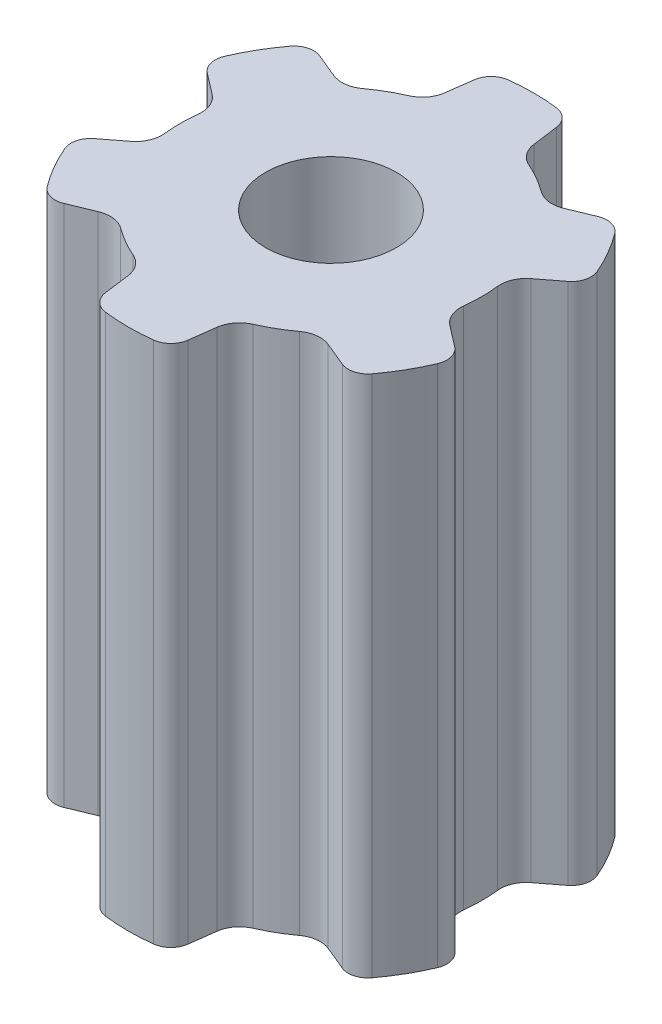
ISO-10303-21;
HEADER;
FILE_DESCRIPTION(('STEP AP214'),'2;1');
FILE_NAME('part.step','',(''),(''),'','','');
FILE_SCHEMA(('AUTOMOTIVE_DESIGN { 1 0 10303 214 1 1 1 1 }'));
ENDSEC;
DATA;
#1=APPLICATION_CONTEXT('core data for automotive mechanical design processes');
#2=APPLICATION_PROTOCOL_DEFINITION('international standard','automotive_design',2000,#1);
#3=PRODUCT_CONTEXT('',#1,'mechanical');
#4=PRODUCT('Part','Part','',(#3));
#5=PRODUCT_RELATED_PRODUCT_CATEGORY('part','',(#4));
#6=PRODUCT_DEFINITION_FORMATION('','',#4);
#7=PRODUCT_DEFINITION_CONTEXT('part definition',#1,'design');
#8=PRODUCT_DEFINITION('design','',#6,#7);
#9=PRODUCT_DEFINITION_SHAPE('','',#8);
#10=(LENGTH_UNIT() NAMED_UNIT(*) SI_UNIT(.MILLI.,.METRE.));
#11=(NAMED_UNIT(*) PLANE_ANGLE_UNIT() SI_UNIT($,.RADIAN.));
#12=(NAMED_UNIT(*) SI_UNIT($,.STERADIAN.) SOLID_ANGLE_UNIT());
#13=UNCERTAINTY_MEASURE_WITH_UNIT(LENGTH_MEASURE(1.E-05),#10,'distance_accuracy_value','');
#14=(GEOMETRIC_REPRESENTATION_CONTEXT(3) GLOBAL_UNCERTAINTY_ASSIGNED_CONTEXT((#13)) GLOBAL_UNIT_ASSIGNED_CONTEXT((#10,
#11,#12)) REPRESENTATION_CONTEXT('',''));
#15=CARTESIAN_POINT('',(0.,0.,0.));
#16=DIRECTION('',(0.,0.,1.));
#17=DIRECTION('',(1.,0.,0.));
#18=AXIS2_PLACEMENT_3D('',#15,#16,#17);
#19=CARTESIAN_POINT('',(0.,10.,0.));
#20=DIRECTION('',(0.,-1.,0.));
#21=DIRECTION('',(0.,0.,-1.));
#22=AXIS2_PLACEMENT_3D('',#19,#20,#21);
#23=CYLINDRICAL_SURFACE('',#22,2.875);
#24=CARTESIAN_POINT('',(0.,10.,0.));
#25=DIRECTION('',(0.,1.,0.));
#26=DIRECTION('',(0.,0.,1.));
#27=AXIS2_PLACEMENT_3D('',#24,#25,#26);
#28=CIRCLE('',#27,2.875);
#29=CARTESIAN_POINT('',(-2.85669364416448,10.,-0.323923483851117));
#30=VERTEX_POINT('',#29);
#31=CARTESIAN_POINT('',(-2.85669364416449,10.,0.323923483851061));
#32=VERTEX_POINT('',#31);
#33=EDGE_CURVE('E49',#30,#32,#28,.T.);
#34=ORIENTED_EDGE('',*,*,#33,.F.);
#35=DIRECTION('',(0.,-1.,0.));
#36=VECTOR('',#35,1.);
#37=CARTESIAN_POINT('',(-2.85669364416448,10.,-0.323923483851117));
#38=LINE('',#37,#36);
#39=CARTESIAN_POINT('',(-2.85669364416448,0.,-0.323923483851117));
#40=VERTEX_POINT('',#39);
#41=EDGE_CURVE('E702',#30,#40,#38,.T.);
#42=ORIENTED_EDGE('',*,*,#41,.T.);
#43=CARTESIAN_POINT('',(0.,0.,0.));
#44=DIRECTION('',(0.,1.,0.));
#45=DIRECTION('',(0.,0.,1.));
#46=AXIS2_PLACEMENT_3D('',#43,#44,#45);
#47=CIRCLE('',#46,2.875);
#48=CARTESIAN_POINT('',(-2.85669364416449,0.,0.323923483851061));
#49=VERTEX_POINT('',#48);
#50=EDGE_CURVE('E57',#40,#49,#47,.T.);
#51=ORIENTED_EDGE('',*,*,#50,.T.);
#52=DIRECTION('',(0.,-1.,0.));
#53=VECTOR('',#52,1.);
#54=CARTESIAN_POINT('',(-2.85669364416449,10.,0.32392348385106));
#55=LINE('',#54,#53);
#56=EDGE_CURVE('E647',#49,#32,#55,.F.);
#57=ORIENTED_EDGE('',*,*,#56,.T.);
#58=EDGE_LOOP('',(#34,#42,#51,#57));
#59=FACE_BOUND('',#58,.T.);
#60=ADVANCED_FACE('F34',(#59),#23,.T.);
#61=CARTESIAN_POINT('',(-3.21710051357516,10.,-1.37850073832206));
#62=DIRECTION('',(0.,-1.,0.));
#63=DIRECTION('',(-0.866025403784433,0.,-0.50000000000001));
#64=AXIS2_PLACEMENT_3D('',#61,#62,#63);
#65=CYLINDRICAL_SURFACE('',#64,0.375);
#66=CARTESIAN_POINT('',(-3.21710051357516,10.,-1.37850073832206));
#67=DIRECTION('',(0.,1.,0.));
#68=DIRECTION('',(0.866025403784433,0.,0.50000000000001));
#69=AXIS2_PLACEMENT_3D('',#66,#67,#68);
#70=CIRCLE('',#69,0.375);
#71=CARTESIAN_POINT('',(-3.56178985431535,10.,-1.52619724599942));
#72=VERTEX_POINT('',#71);
#73=CARTESIAN_POINT('',(-3.44538604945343,10.,-1.08099323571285));
#74=VERTEX_POINT('',#73);
#75=EDGE_CURVE('E42',#72,#74,#70,.T.);
#76=ORIENTED_EDGE('',*,*,#75,.F.);
#77=DIRECTION('',(0.,-1.,0.));
#78=VECTOR('',#77,1.);
#79=CARTESIAN_POINT('',(-3.56178985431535,10.,-1.52619724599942));
#80=LINE('',#79,#78);
#81=CARTESIAN_POINT('',(-3.56178985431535,0.,-1.52619724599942));
#82=VERTEX_POINT('',#81);
#83=EDGE_CURVE('E676',#82,#72,#80,.F.);
#84=ORIENTED_EDGE('',*,*,#83,.F.);
#85=CARTESIAN_POINT('',(-3.21710051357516,0.,-1.37850073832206));
#86=DIRECTION('',(0.,1.,0.));
#87=DIRECTION('',(0.866025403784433,0.,0.50000000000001));
#88=AXIS2_PLACEMENT_3D('',#85,#86,#87);
#89=CIRCLE('',#88,0.375);
#90=CARTESIAN_POINT('',(-3.44538604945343,0.,-1.08099323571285));
#91=VERTEX_POINT('',#90);
#92=EDGE_CURVE('E11',#91,#82,#89,.F.);
#93=ORIENTED_EDGE('',*,*,#92,.F.);
#94=DIRECTION('',(0.,-1.,0.));
#95=VECTOR('',#94,1.);
#96=CARTESIAN_POINT('',(-3.44538604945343,10.,-1.08099323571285));
#97=LINE('',#96,#95);
#98=EDGE_CURVE('E667',#74,#91,#97,.T.);
#99=ORIENTED_EDGE('',*,*,#98,.F.);
#100=EDGE_LOOP('',(#76,#84,#93,#99));
#101=FACE_BOUND('',#100,.T.);
#102=ADVANCED_FACE('F36',(#101),#65,.T.);
#103=CARTESIAN_POINT('',(-2.80236691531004,10.,-2.09684040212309));
#104=DIRECTION('',(0.,-1.,0.));
#105=DIRECTION('',(-0.866025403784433,0.,-0.50000000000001));
#106=AXIS2_PLACEMENT_3D('',#103,#104,#105);
#107=CYLINDRICAL_SURFACE('',#106,0.375);
#108=CARTESIAN_POINT('',(-2.80236691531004,10.,-2.09684040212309));
#109=DIRECTION('',(0.,1.,0.));
#110=DIRECTION('',(0.866025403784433,0.,0.50000000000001));
#111=AXIS2_PLACEMENT_3D('',#108,#109,#110);
#112=CIRCLE('',#111,0.375);
#113=CARTESIAN_POINT('',(-2.65886062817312,10.,-2.44329522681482));
#114=VERTEX_POINT('',#113);
#115=CARTESIAN_POINT('',(-3.10262051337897,10.,-2.32150187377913));
#116=VERTEX_POINT('',#115);
#117=EDGE_CURVE('E704',#114,#116,#112,.T.);
#118=ORIENTED_EDGE('',*,*,#117,.F.);
#119=DIRECTION('',(0.,1.,0.));
#120=VECTOR('',#119,1.);
#121=CARTESIAN_POINT('',(-2.65886062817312,10.,-2.44329522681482));
#122=LINE('',#121,#120);
#123=CARTESIAN_POINT('',(-2.65886062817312,0.,-2.44329522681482));
#124=VERTEX_POINT('',#123);
#125=EDGE_CURVE('E686',#124,#114,#122,.T.);
#126=ORIENTED_EDGE('',*,*,#125,.F.);
#127=CARTESIAN_POINT('',(-2.80236691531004,0.,-2.09684040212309));
#128=DIRECTION('',(0.,1.,0.));
#129=DIRECTION('',(0.866025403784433,0.,0.50000000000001));
#130=AXIS2_PLACEMENT_3D('',#127,#128,#129);
#131=CIRCLE('',#130,0.375);
#132=CARTESIAN_POINT('',(-3.10262051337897,0.,-2.32150187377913));
#133=VERTEX_POINT('',#132);
#134=EDGE_CURVE('E707',#133,#124,#131,.F.);
#135=ORIENTED_EDGE('',*,*,#134,.F.);
#136=DIRECTION('',(0.,-1.,0.));
#137=VECTOR('',#136,1.);
#138=CARTESIAN_POINT('',(-3.10262051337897,10.,-2.32150187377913));
#139=LINE('',#138,#137);
#140=EDGE_CURVE('E681',#116,#133,#139,.T.);
#141=ORIENTED_EDGE('',*,*,#140,.F.);
#142=EDGE_LOOP('',(#118,#126,#135,#141));
#143=FACE_BOUND('',#142,.T.);
#144=ADVANCED_FACE('F898',(#143),#107,.T.);
#145=CARTESIAN_POINT('',(-3.35350993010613,10.,-0.380258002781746));
#146=DIRECTION('',(0.,-1.,0.));
#147=DIRECTION('',(-0.866025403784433,0.,-0.50000000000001));
#148=AXIS2_PLACEMENT_3D('',#145,#146,#147);
#149=CYLINDRICAL_SURFACE('',#148,0.5);
#150=CARTESIAN_POINT('',(-3.35350993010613,10.,-0.380258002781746));
#151=DIRECTION('',(0.,1.,0.));
#152=DIRECTION('',(0.866025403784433,0.,0.50000000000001));
#153=AXIS2_PLACEMENT_3D('',#150,#151,#152);
#154=CIRCLE('',#153,0.5);
#155=CARTESIAN_POINT('',(-3.04912921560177,10.,-0.776934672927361));
#156=VERTEX_POINT('',#155);
#157=EDGE_CURVE('E698',#156,#30,#154,.F.);
#158=ORIENTED_EDGE('',*,*,#157,.F.);
#159=DIRECTION('',(0.,1.,0.));
#160=VECTOR('',#159,1.);
#161=CARTESIAN_POINT('',(-3.04912921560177,10.,-0.77693467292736));
#162=LINE('',#161,#160);
#163=CARTESIAN_POINT('',(-3.04912921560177,0.,-0.776934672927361));
#164=VERTEX_POINT('',#163);
#165=EDGE_CURVE('E671',#164,#156,#162,.T.);
#166=ORIENTED_EDGE('',*,*,#165,.F.);
#167=CARTESIAN_POINT('',(-3.35350993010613,0.,-0.380258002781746));
#168=DIRECTION('',(0.,1.,0.));
#169=DIRECTION('',(0.866025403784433,0.,0.50000000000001));
#170=AXIS2_PLACEMENT_3D('',#167,#168,#169);
#171=CIRCLE('',#170,0.5);
#172=EDGE_CURVE('E700',#40,#164,#171,.T.);
#173=ORIENTED_EDGE('',*,*,#172,.F.);
#174=ORIENTED_EDGE('',*,*,#41,.F.);
#175=EDGE_LOOP('',(#158,#166,#173,#174));
#176=FACE_BOUND('',#175,.T.);
#177=ADVANCED_FACE('F724',(#176),#149,.F.);
#178=CARTESIAN_POINT('',(-2.00606805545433,10.,-2.71409578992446));
#179=DIRECTION('',(0.,-1.,0.));
#180=DIRECTION('',(-0.866025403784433,0.,-0.50000000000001));
#181=AXIS2_PLACEMENT_3D('',#178,#179,#180);
#182=CYLINDRICAL_SURFACE('',#181,0.5);
#183=CARTESIAN_POINT('',(-2.00606805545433,10.,-2.71409578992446));
#184=DIRECTION('',(0.,1.,0.));
#185=DIRECTION('',(0.866025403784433,0.,0.50000000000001));
#186=AXIS2_PLACEMENT_3D('',#183,#184,#185);
#187=CIRCLE('',#186,0.5);
#188=CARTESIAN_POINT('',(-1.70887278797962,10.,-2.31200752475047));
#189=VERTEX_POINT('',#188);
#190=CARTESIAN_POINT('',(-2.19740977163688,10.,-2.25215602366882));
#191=VERTEX_POINT('',#190);
#192=EDGE_CURVE('E693',#189,#191,#187,.F.);
#193=ORIENTED_EDGE('',*,*,#192,.F.);
#194=DIRECTION('',(0.,-1.,0.));
#195=VECTOR('',#194,1.);
#196=CARTESIAN_POINT('',(-1.70887278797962,10.,-2.31200752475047));
#197=LINE('',#196,#195);
#198=CARTESIAN_POINT('',(-1.70887278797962,0.,-2.31200752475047));
#199=VERTEX_POINT('',#198);
#200=EDGE_CURVE('E695',#199,#189,#197,.F.);
#201=ORIENTED_EDGE('',*,*,#200,.F.);
#202=CARTESIAN_POINT('',(-2.00606805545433,0.,-2.71409578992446));
#203=DIRECTION('',(0.,1.,0.));
#204=DIRECTION('',(0.866025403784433,0.,0.50000000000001));
#205=AXIS2_PLACEMENT_3D('',#202,#203,#204);
#206=CIRCLE('',#205,0.5);
#207=CARTESIAN_POINT('',(-2.19740977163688,0.,-2.25215602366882));
#208=VERTEX_POINT('',#207);
#209=EDGE_CURVE('E367',#208,#199,#206,.T.);
#210=ORIENTED_EDGE('',*,*,#209,.F.);
#211=DIRECTION('',(0.,-1.,0.));
#212=VECTOR('',#211,1.);
#213=CARTESIAN_POINT('',(-2.19740977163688,10.,-2.25215602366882));
#214=LINE('',#213,#212);
#215=EDGE_CURVE('E690',#191,#208,#214,.T.);
#216=ORIENTED_EDGE('',*,*,#215,.F.);
#217=EDGE_LOOP('',(#193,#201,#210,#216));
#218=FACE_BOUND('',#217,.T.);
#219=ADVANCED_FACE('F954',(#218),#182,.F.);
#220=CARTESIAN_POINT('',(-0.570633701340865,10.,-1.57832331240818));
#221=DIRECTION('',(0.3826834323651,0.,-0.923879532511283));
#222=DIRECTION('',(-0.923879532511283,0.,-0.3826834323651));
#223=AXIS2_PLACEMENT_3D('',#220,#221,#222);
#224=PLANE('',#223);
#225=DIRECTION('',(0.923879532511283,0.,0.3826834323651));
#226=VECTOR('',#225,1.);
#227=CARTESIAN_POINT('',(-0.570633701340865,0.,-1.57832331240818));
#228=LINE('',#227,#226);
#229=EDGE_CURVE('E684',#124,#208,#228,.T.);
#230=ORIENTED_EDGE('',*,*,#229,.F.);
#231=ORIENTED_EDGE('',*,*,#125,.T.);
#232=DIRECTION('',(0.923879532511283,0.,0.3826834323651));
#233=VECTOR('',#232,1.);
#234=CARTESIAN_POINT('',(-0.570633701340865,10.,-1.57832331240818));
#235=LINE('',#234,#233);
#236=EDGE_CURVE('E688',#114,#191,#235,.T.);
#237=ORIENTED_EDGE('',*,*,#236,.T.);
#238=ORIENTED_EDGE('',*,*,#215,.T.);
#239=EDGE_LOOP('',(#230,#231,#237,#238));
#240=FACE_BOUND('',#239,.T.);
#241=ADVANCED_FACE('F950',(#240),#224,.T.);
#242=CARTESIAN_POINT('',(0.,10.,0.));
#243=DIRECTION('',(0.,-1.,0.));
#244=DIRECTION('',(-0.866025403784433,0.,-0.50000000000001));
#245=AXIS2_PLACEMENT_3D('',#242,#243,#244);
#246=CYLINDRICAL_SURFACE('',#245,3.875);
#247=CARTESIAN_POINT('',(0.,0.,0.));
#248=DIRECTION('',(0.,1.,0.));
#249=DIRECTION('',(0.866025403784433,0.,0.50000000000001));
#250=AXIS2_PLACEMENT_3D('',#247,#248,#249);
#251=CIRCLE('',#250,3.875);
#252=EDGE_CURVE('E674',#133,#82,#251,.T.);
#253=ORIENTED_EDGE('',*,*,#252,.T.);
#254=ORIENTED_EDGE('',*,*,#83,.T.);
#255=CARTESIAN_POINT('',(0.,10.,0.));
#256=DIRECTION('',(0.,1.,0.));
#257=DIRECTION('',(0.866025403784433,0.,0.50000000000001));
#258=AXIS2_PLACEMENT_3D('',#255,#256,#257);
#259=CIRCLE('',#258,3.875);
#260=EDGE_CURVE('E678',#116,#72,#259,.T.);
#261=ORIENTED_EDGE('',*,*,#260,.F.);
#262=ORIENTED_EDGE('',*,*,#140,.T.);
#263=EDGE_LOOP('',(#253,#254,#261,#262));
#264=FACE_BOUND('',#263,.T.);
#265=ADVANCED_FACE('F947',(#264),#246,.T.);
#266=CARTESIAN_POINT('',(0.142689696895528,10.,1.67223411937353));
#267=DIRECTION('',(0.608761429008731,0.,-0.793353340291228));
#268=DIRECTION('',(-0.793353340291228,0.,-0.608761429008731));
#269=AXIS2_PLACEMENT_3D('',#266,#267,#268);
#270=PLANE('',#269);
#271=DIRECTION('',(0.793353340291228,0.,0.608761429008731));
#272=VECTOR('',#271,1.);
#273=CARTESIAN_POINT('',(0.142689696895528,10.,1.67223411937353));
#274=LINE('',#273,#272);
#275=EDGE_CURVE('E377',#74,#156,#274,.T.);
#276=ORIENTED_EDGE('',*,*,#275,.F.);
#277=ORIENTED_EDGE('',*,*,#98,.T.);
#278=DIRECTION('',(0.793353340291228,0.,0.608761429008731));
#279=VECTOR('',#278,1.);
#280=CARTESIAN_POINT('',(0.142689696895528,0.,1.67223411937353));
#281=LINE('',#280,#279);
#282=EDGE_CURVE('E669',#91,#164,#281,.T.);
#283=ORIENTED_EDGE('',*,*,#282,.T.);
#284=ORIENTED_EDGE('',*,*,#165,.T.);
#285=EDGE_LOOP('',(#276,#277,#283,#284));
#286=FACE_BOUND('',#285,.T.);
#287=ADVANCED_FACE('F719',(#286),#270,.F.);
#288=CARTESIAN_POINT('',(-1.70887278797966,10.,2.31200752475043));
#289=VERTEX_POINT('',#288);
#290=CARTESIAN_POINT('',(-1.14782085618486,10.,2.63593100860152));
#291=VERTEX_POINT('',#290);
#292=EDGE_CURVE('E409',#289,#291,#28,.T.);
#293=ORIENTED_EDGE('',*,*,#292,.F.);
#294=DIRECTION('',(0.,-1.,0.));
#295=VECTOR('',#294,1.);
#296=CARTESIAN_POINT('',(-1.70887278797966,10.,2.31200752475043));
#297=LINE('',#296,#295);
#298=CARTESIAN_POINT('',(-1.70887278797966,0.,2.31200752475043));
#299=VERTEX_POINT('',#298);
#300=EDGE_CURVE('E656',#289,#299,#297,.T.);
#301=ORIENTED_EDGE('',*,*,#300,.T.);
#302=CARTESIAN_POINT('',(-1.14782085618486,0.,2.63593100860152));
#303=VERTEX_POINT('',#302);
#304=EDGE_CURVE('E378',#299,#303,#47,.T.);
#305=ORIENTED_EDGE('',*,*,#304,.T.);
#306=DIRECTION('',(0.,-1.,0.));
#307=VECTOR('',#306,1.);
#308=CARTESIAN_POINT('',(-1.14782085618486,10.,2.63593100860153));
#309=LINE('',#308,#307);
#310=EDGE_CURVE('E599',#303,#291,#309,.F.);
#311=ORIENTED_EDGE('',*,*,#310,.T.);
#312=EDGE_LOOP('',(#293,#301,#305,#311));
#313=FACE_BOUND('',#312,.T.);
#314=ADVANCED_FACE('F756',(#313),#23,.T.);
#315=CARTESIAN_POINT('',(-2.80236691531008,10.,2.09684040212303));
#316=DIRECTION('',(0.,-1.,0.));
#317=DIRECTION('',(-0.866025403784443,0.,0.499999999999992));
#318=AXIS2_PLACEMENT_3D('',#315,#316,#317);
#319=CYLINDRICAL_SURFACE('',#318,0.375);
#320=CARTESIAN_POINT('',(-2.80236691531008,10.,2.09684040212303));
#321=DIRECTION('',(0.,1.,0.));
#322=DIRECTION('',(0.866025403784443,0.,-0.499999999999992));
#323=AXIS2_PLACEMENT_3D('',#320,#321,#322);
#324=CIRCLE('',#323,0.375);
#325=CARTESIAN_POINT('',(-3.10262051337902,10.,2.32150187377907));
#326=VERTEX_POINT('',#325);
#327=CARTESIAN_POINT('',(-2.65886062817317,10.,2.44329522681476));
#328=VERTEX_POINT('',#327);
#329=EDGE_CURVE('E430',#326,#328,#324,.T.);
#330=ORIENTED_EDGE('',*,*,#329,.F.);
#331=DIRECTION('',(0.,-1.,0.));
#332=VECTOR('',#331,1.);
#333=CARTESIAN_POINT('',(-3.10262051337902,10.,2.32150187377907));
#334=LINE('',#333,#332);
#335=CARTESIAN_POINT('',(-3.10262051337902,0.,2.32150187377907));
#336=VERTEX_POINT('',#335);
#337=EDGE_CURVE('E628',#336,#326,#334,.F.);
#338=ORIENTED_EDGE('',*,*,#337,.F.);
#339=CARTESIAN_POINT('',(-2.80236691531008,0.,2.09684040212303));
#340=DIRECTION('',(0.,1.,0.));
#341=DIRECTION('',(0.866025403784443,0.,-0.499999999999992));
#342=AXIS2_PLACEMENT_3D('',#339,#340,#341);
#343=CIRCLE('',#342,0.375);
#344=CARTESIAN_POINT('',(-2.65886062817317,0.,2.44329522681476));
#345=VERTEX_POINT('',#344);
#346=EDGE_CURVE('E426',#345,#336,#343,.F.);
#347=ORIENTED_EDGE('',*,*,#346,.F.);
#348=DIRECTION('',(0.,-1.,0.));
#349=VECTOR('',#348,1.);
#350=CARTESIAN_POINT('',(-2.65886062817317,10.,2.44329522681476));
#351=LINE('',#350,#349);
#352=EDGE_CURVE('E415',#328,#345,#351,.T.);
#353=ORIENTED_EDGE('',*,*,#352,.F.);
#354=EDGE_LOOP('',(#330,#338,#347,#353));
#355=FACE_BOUND('',#354,.T.);
#356=ADVANCED_FACE('F745',(#355),#319,.T.);
#357=CARTESIAN_POINT('',(-3.21710051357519,10.,1.37850073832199));
#358=DIRECTION('',(0.,-1.,0.));
#359=DIRECTION('',(-0.866025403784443,0.,0.499999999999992));
#360=AXIS2_PLACEMENT_3D('',#357,#358,#359);
#361=CYLINDRICAL_SURFACE('',#360,0.375);
#362=CARTESIAN_POINT('',(-3.21710051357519,10.,1.37850073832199));
#363=DIRECTION('',(0.,1.,0.));
#364=DIRECTION('',(0.866025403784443,0.,-0.499999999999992));
#365=AXIS2_PLACEMENT_3D('',#362,#363,#364);
#366=CIRCLE('',#365,0.375);
#367=CARTESIAN_POINT('',(-3.44538604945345,10.,1.08099323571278));
#368=VERTEX_POINT('',#367);
#369=CARTESIAN_POINT('',(-3.56178985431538,10.,1.52619724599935));
#370=VERTEX_POINT('',#369);
#371=EDGE_CURVE('E658',#368,#370,#366,.T.);
#372=ORIENTED_EDGE('',*,*,#371,.F.);
#373=DIRECTION('',(0.,1.,0.));
#374=VECTOR('',#373,1.);
#375=CARTESIAN_POINT('',(-3.44538604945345,10.,1.08099323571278));
#376=LINE('',#375,#374);
#377=CARTESIAN_POINT('',(-3.44538604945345,0.,1.08099323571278));
#378=VERTEX_POINT('',#377);
#379=EDGE_CURVE('E638',#378,#368,#376,.T.);
#380=ORIENTED_EDGE('',*,*,#379,.F.);
#381=CARTESIAN_POINT('',(-3.21710051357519,0.,1.37850073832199));
#382=DIRECTION('',(0.,1.,0.));
#383=DIRECTION('',(0.866025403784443,0.,-0.499999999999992));
#384=AXIS2_PLACEMENT_3D('',#381,#382,#383);
#385=CIRCLE('',#384,0.375);
#386=CARTESIAN_POINT('',(-3.56178985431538,0.,1.52619724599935));
#387=VERTEX_POINT('',#386);
#388=EDGE_CURVE('E661',#387,#378,#385,.F.);
#389=ORIENTED_EDGE('',*,*,#388,.F.);
#390=DIRECTION('',(0.,-1.,0.));
#391=VECTOR('',#390,1.);
#392=CARTESIAN_POINT('',(-3.56178985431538,10.,1.52619724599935));
#393=LINE('',#392,#391);
#394=EDGE_CURVE('E633',#370,#387,#393,.T.);
#395=ORIENTED_EDGE('',*,*,#394,.F.);
#396=EDGE_LOOP('',(#372,#380,#389,#395));
#397=FACE_BOUND('',#396,.T.);
#398=ADVANCED_FACE('F738',(#397),#361,.T.);
#399=CARTESIAN_POINT('',(-2.00606805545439,10.,2.71409578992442));
#400=DIRECTION('',(0.,-1.,0.));
#401=DIRECTION('',(-0.866025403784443,0.,0.499999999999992));
#402=AXIS2_PLACEMENT_3D('',#399,#400,#401);
#403=CYLINDRICAL_SURFACE('',#402,0.5);
#404=CARTESIAN_POINT('',(-2.00606805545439,10.,2.71409578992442));
#405=DIRECTION('',(0.,1.,0.));
#406=DIRECTION('',(0.866025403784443,0.,-0.499999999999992));
#407=AXIS2_PLACEMENT_3D('',#404,#405,#406);
#408=CIRCLE('',#407,0.5);
#409=CARTESIAN_POINT('',(-2.19740977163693,10.,2.25215602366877));
#410=VERTEX_POINT('',#409);
#411=EDGE_CURVE('E651',#410,#289,#408,.F.);
#412=ORIENTED_EDGE('',*,*,#411,.F.);
#413=DIRECTION('',(0.,1.,0.));
#414=VECTOR('',#413,1.);
#415=CARTESIAN_POINT('',(-2.19740977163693,10.,2.25215602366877));
#416=LINE('',#415,#414);
#417=CARTESIAN_POINT('',(-2.19740977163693,0.,2.25215602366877));
#418=VERTEX_POINT('',#417);
#419=EDGE_CURVE('E623',#418,#410,#416,.T.);
#420=ORIENTED_EDGE('',*,*,#419,.F.);
#421=CARTESIAN_POINT('',(-2.00606805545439,0.,2.71409578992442));
#422=DIRECTION('',(0.,1.,0.));
#423=DIRECTION('',(0.866025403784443,0.,-0.499999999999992));
#424=AXIS2_PLACEMENT_3D('',#421,#422,#423);
#425=CIRCLE('',#424,0.5);
#426=EDGE_CURVE('E653',#299,#418,#425,.T.);
#427=ORIENTED_EDGE('',*,*,#426,.F.);
#428=ORIENTED_EDGE('',*,*,#300,.F.);
#429=EDGE_LOOP('',(#412,#420,#427,#428));
#430=FACE_BOUND('',#429,.T.);
#431=ADVANCED_FACE('F755',(#430),#403,.F.);
#432=CARTESIAN_POINT('',(-3.35350993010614,10.,0.38025800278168));
#433=DIRECTION('',(0.,-1.,0.));
#434=DIRECTION('',(-0.866025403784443,0.,0.499999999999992));
#435=AXIS2_PLACEMENT_3D('',#432,#433,#434);
#436=CYLINDRICAL_SURFACE('',#435,0.5);
#437=CARTESIAN_POINT('',(-3.35350993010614,10.,0.38025800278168));
#438=DIRECTION('',(0.,1.,0.));
#439=DIRECTION('',(0.866025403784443,0.,-0.499999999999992));
#440=AXIS2_PLACEMENT_3D('',#437,#438,#439);
#441=CIRCLE('',#440,0.5);
#442=CARTESIAN_POINT('',(-3.04912921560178,10.,0.776934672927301));
#443=VERTEX_POINT('',#442);
#444=EDGE_CURVE('E645',#32,#443,#441,.F.);
#445=ORIENTED_EDGE('',*,*,#444,.F.);
#446=ORIENTED_EDGE('',*,*,#56,.F.);
#447=CARTESIAN_POINT('',(-3.35350993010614,0.,0.38025800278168));
#448=DIRECTION('',(0.,1.,0.));
#449=DIRECTION('',(0.866025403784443,0.,-0.499999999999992));
#450=AXIS2_PLACEMENT_3D('',#447,#448,#449);
#451=CIRCLE('',#450,0.5);
#452=CARTESIAN_POINT('',(-3.04912921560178,0.,0.776934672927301));
#453=VERTEX_POINT('',#452);
#454=EDGE_CURVE('E649',#453,#49,#451,.T.);
#455=ORIENTED_EDGE('',*,*,#454,.F.);
#456=DIRECTION('',(0.,-1.,0.));
#457=VECTOR('',#456,1.);
#458=CARTESIAN_POINT('',(-3.04912921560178,10.,0.7769346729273));
#459=LINE('',#458,#457);
#460=EDGE_CURVE('E642',#443,#453,#459,.T.);
#461=ORIENTED_EDGE('',*,*,#460,.F.);
#462=EDGE_LOOP('',(#445,#446,#455,#461));
#463=FACE_BOUND('',#462,.T.);
#464=ADVANCED_FACE('F728',(#463),#436,.F.);
#465=CARTESIAN_POINT('',(-1.65218493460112,10.,-0.294978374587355));
#466=DIRECTION('',(-0.608761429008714,0.,-0.79335334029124));
#467=DIRECTION('',(-0.79335334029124,0.,0.608761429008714));
#468=AXIS2_PLACEMENT_3D('',#465,#466,#467);
#469=PLANE('',#468);
#470=DIRECTION('',(0.79335334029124,0.,-0.608761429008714));
#471=VECTOR('',#470,1.);
#472=CARTESIAN_POINT('',(-1.65218493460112,0.,-0.294978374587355));
#473=LINE('',#472,#471);
#474=EDGE_CURVE('E636',#378,#453,#473,.T.);
#475=ORIENTED_EDGE('',*,*,#474,.F.);
#476=ORIENTED_EDGE('',*,*,#379,.T.);
#477=DIRECTION('',(0.79335334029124,0.,-0.608761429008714));
#478=VECTOR('',#477,1.);
#479=CARTESIAN_POINT('',(-1.65218493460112,10.,-0.294978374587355));
#480=LINE('',#479,#478);
#481=EDGE_CURVE('E640',#368,#443,#480,.T.);
#482=ORIENTED_EDGE('',*,*,#481,.T.);
#483=ORIENTED_EDGE('',*,*,#460,.T.);
#484=EDGE_LOOP('',(#475,#476,#482,#483));
#485=FACE_BOUND('',#484,.T.);
#486=ADVANCED_FACE('F733',(#485),#469,.T.);
#487=CARTESIAN_POINT('',(0.,10.,0.));
#488=DIRECTION('',(0.,-1.,0.));
#489=DIRECTION('',(-0.866025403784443,0.,0.499999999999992));
#490=AXIS2_PLACEMENT_3D('',#487,#488,#489);
#491=CYLINDRICAL_SURFACE('',#490,3.875);
#492=CARTESIAN_POINT('',(0.,0.,0.));
#493=DIRECTION('',(0.,1.,0.));
#494=DIRECTION('',(0.866025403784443,0.,-0.499999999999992));
#495=AXIS2_PLACEMENT_3D('',#492,#493,#494);
#496=CIRCLE('',#495,3.875);
#497=EDGE_CURVE('E626',#387,#336,#496,.T.);
#498=ORIENTED_EDGE('',*,*,#497,.T.);
#499=ORIENTED_EDGE('',*,*,#337,.T.);
#500=CARTESIAN_POINT('',(0.,10.,0.));
#501=DIRECTION('',(0.,1.,0.));
#502=DIRECTION('',(0.866025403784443,0.,-0.499999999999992));
#503=AXIS2_PLACEMENT_3D('',#500,#501,#502);
#504=CIRCLE('',#503,3.875);
#505=EDGE_CURVE('E630',#370,#326,#504,.T.);
#506=ORIENTED_EDGE('',*,*,#505,.F.);
#507=ORIENTED_EDGE('',*,*,#394,.T.);
#508=EDGE_LOOP('',(#498,#499,#506,#507));
#509=FACE_BOUND('',#508,.T.);
#510=ADVANCED_FACE('F740',(#509),#491,.T.);
#511=CARTESIAN_POINT('',(1.51954207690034,10.,0.712544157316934));
#512=DIRECTION('',(-0.382683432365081,0.,-0.923879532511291));
#513=DIRECTION('',(-0.923879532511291,0.,0.382683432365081));
#514=AXIS2_PLACEMENT_3D('',#511,#512,#513);
#515=PLANE('',#514);
#516=DIRECTION('',(0.923879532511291,0.,-0.382683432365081));
#517=VECTOR('',#516,1.);
#518=CARTESIAN_POINT('',(1.51954207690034,10.,0.712544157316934));
#519=LINE('',#518,#517);
#520=EDGE_CURVE('E410',#328,#410,#519,.T.);
#521=ORIENTED_EDGE('',*,*,#520,.F.);
#522=ORIENTED_EDGE('',*,*,#352,.T.);
#523=DIRECTION('',(0.923879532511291,0.,-0.382683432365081));
#524=VECTOR('',#523,1.);
#525=CARTESIAN_POINT('',(1.51954207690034,0.,0.712544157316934));
#526=LINE('',#525,#524);
#527=EDGE_CURVE('E621',#345,#418,#526,.T.);
#528=ORIENTED_EDGE('',*,*,#527,.T.);
#529=ORIENTED_EDGE('',*,*,#419,.T.);
#530=EDGE_LOOP('',(#521,#522,#528,#529));
#531=FACE_BOUND('',#530,.T.);
#532=ADVANCED_FACE('F749',(#531),#515,.F.);
#533=CARTESIAN_POINT('',(1.14782085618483,10.,2.63593100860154));
#534=VERTEX_POINT('',#533);
#535=CARTESIAN_POINT('',(1.70887278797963,10.,2.31200752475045));
#536=VERTEX_POINT('',#535);
#537=EDGE_CURVE('E400',#534,#536,#28,.T.);
#538=ORIENTED_EDGE('',*,*,#537,.F.);
#539=DIRECTION('',(0.,-1.,0.));
#540=VECTOR('',#539,1.);
#541=CARTESIAN_POINT('',(1.14782085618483,10.,2.63593100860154));
#542=LINE('',#541,#540);
#543=CARTESIAN_POINT('',(1.14782085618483,0.,2.63593100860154));
#544=VERTEX_POINT('',#543);
#545=EDGE_CURVE('E610',#534,#544,#542,.T.);
#546=ORIENTED_EDGE('',*,*,#545,.T.);
#547=CARTESIAN_POINT('',(1.70887278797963,0.,2.31200752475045));
#548=VERTEX_POINT('',#547);
#549=EDGE_CURVE('E392',#544,#548,#47,.T.);
#550=ORIENTED_EDGE('',*,*,#549,.T.);
#551=DIRECTION('',(0.,-1.,0.));
#552=VECTOR('',#551,1.);
#553=CARTESIAN_POINT('',(1.70887278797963,10.,2.31200752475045));
#554=LINE('',#553,#552);
#555=EDGE_CURVE('E548',#548,#536,#554,.F.);
#556=ORIENTED_EDGE('',*,*,#555,.T.);
#557=EDGE_LOOP('',(#538,#546,#550,#556));
#558=FACE_BOUND('',#557,.T.);
#559=ADVANCED_FACE('F787',(#558),#23,.T.);
#560=CARTESIAN_POINT('',(0.414733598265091,10.,3.47534114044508));
#561=DIRECTION('',(0.,-1.,0.));
#562=DIRECTION('',(0.,0.,1.));
#563=AXIS2_PLACEMENT_3D('',#560,#561,#562);
#564=CYLINDRICAL_SURFACE('',#563,0.375);
#565=CARTESIAN_POINT('',(0.414733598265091,10.,3.47534114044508));
#566=DIRECTION('',(0.,1.,0.));
#567=DIRECTION('',(0.,0.,-1.));
#568=AXIS2_PLACEMENT_3D('',#565,#566,#567);
#569=CIRCLE('',#568,0.375);
#570=CARTESIAN_POINT('',(0.45916934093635,10.,3.84769911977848));
#571=VERTEX_POINT('',#570);
#572=CARTESIAN_POINT('',(0.786525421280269,10.,3.5242884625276));
#573=VERTEX_POINT('',#572);
#574=EDGE_CURVE('E423',#571,#573,#569,.T.);
#575=ORIENTED_EDGE('',*,*,#574,.F.);
#576=DIRECTION('',(0.,-1.,0.));
#577=VECTOR('',#576,1.);
#578=CARTESIAN_POINT('',(0.45916934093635,10.,3.84769911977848));
#579=LINE('',#578,#577);
#580=CARTESIAN_POINT('',(0.45916934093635,0.,3.84769911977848));
#581=VERTEX_POINT('',#580);
#582=EDGE_CURVE('E580',#581,#571,#579,.F.);
#583=ORIENTED_EDGE('',*,*,#582,.F.);
#584=CARTESIAN_POINT('',(0.414733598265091,0.,3.47534114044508));
#585=DIRECTION('',(0.,1.,0.));
#586=DIRECTION('',(0.,0.,-1.));
#587=AXIS2_PLACEMENT_3D('',#584,#585,#586);
#588=CIRCLE('',#587,0.375);
#589=CARTESIAN_POINT('',(0.786525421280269,0.,3.5242884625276));
#590=VERTEX_POINT('',#589);
#591=EDGE_CURVE('E417',#590,#581,#588,.F.);
#592=ORIENTED_EDGE('',*,*,#591,.F.);
#593=DIRECTION('',(0.,-1.,0.));
#594=VECTOR('',#593,1.);
#595=CARTESIAN_POINT('',(0.786525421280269,10.,3.5242884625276));
#596=LINE('',#595,#594);
#597=EDGE_CURVE('E406',#573,#590,#596,.T.);
#598=ORIENTED_EDGE('',*,*,#597,.F.);
#599=EDGE_LOOP('',(#575,#583,#592,#598));
#600=FACE_BOUND('',#599,.T.);
#601=ADVANCED_FACE('F776',(#600),#564,.T.);
#602=CARTESIAN_POINT('',(-0.414733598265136,10.,3.47534114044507));
#603=DIRECTION('',(0.,-1.,0.));
#604=DIRECTION('',(0.,0.,1.));
#605=AXIS2_PLACEMENT_3D('',#602,#603,#604);
#606=CYLINDRICAL_SURFACE('',#605,0.375);
#607=CARTESIAN_POINT('',(-0.414733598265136,10.,3.47534114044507));
#608=DIRECTION('',(0.,1.,0.));
#609=DIRECTION('',(0.,0.,-1.));
#610=AXIS2_PLACEMENT_3D('',#607,#608,#609);
#611=CIRCLE('',#610,0.375);
#612=CARTESIAN_POINT('',(-0.786525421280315,10.,3.52428846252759));
#613=VERTEX_POINT('',#612);
#614=CARTESIAN_POINT('',(-0.459169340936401,10.,3.84769911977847));
#615=VERTEX_POINT('',#614);
#616=EDGE_CURVE('E612',#613,#615,#611,.T.);
#617=ORIENTED_EDGE('',*,*,#616,.F.);
#618=DIRECTION('',(0.,1.,0.));
#619=VECTOR('',#618,1.);
#620=CARTESIAN_POINT('',(-0.786525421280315,10.,3.52428846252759));
#621=LINE('',#620,#619);
#622=CARTESIAN_POINT('',(-0.786525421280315,0.,3.52428846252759));
#623=VERTEX_POINT('',#622);
#624=EDGE_CURVE('E590',#623,#613,#621,.T.);
#625=ORIENTED_EDGE('',*,*,#624,.F.);
#626=CARTESIAN_POINT('',(-0.414733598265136,0.,3.47534114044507));
#627=DIRECTION('',(0.,1.,0.));
#628=DIRECTION('',(0.,0.,-1.));
#629=AXIS2_PLACEMENT_3D('',#626,#627,#628);
#630=CIRCLE('',#629,0.375);
#631=CARTESIAN_POINT('',(-0.459169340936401,0.,3.84769911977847));
#632=VERTEX_POINT('',#631);
#633=EDGE_CURVE('E615',#632,#623,#630,.F.);
#634=ORIENTED_EDGE('',*,*,#633,.F.);
#635=DIRECTION('',(0.,-1.,0.));
#636=VECTOR('',#635,1.);
#637=CARTESIAN_POINT('',(-0.459169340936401,10.,3.84769911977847));
#638=LINE('',#637,#636);
#639=EDGE_CURVE('E585',#615,#632,#638,.T.);
#640=ORIENTED_EDGE('',*,*,#639,.F.);
#641=EDGE_LOOP('',(#617,#625,#634,#640));
#642=FACE_BOUND('',#641,.T.);
#643=ADVANCED_FACE('F769',(#642),#606,.T.);
#644=CARTESIAN_POINT('',(1.34744187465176,10.,3.09435379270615));
#645=DIRECTION('',(0.,-1.,0.));
#646=DIRECTION('',(0.,0.,1.));
#647=AXIS2_PLACEMENT_3D('',#644,#645,#646);
#648=CYLINDRICAL_SURFACE('',#647,0.5);
#649=CARTESIAN_POINT('',(1.34744187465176,10.,3.09435379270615));
#650=DIRECTION('',(0.,1.,0.));
#651=DIRECTION('',(0.,0.,-1.));
#652=AXIS2_PLACEMENT_3D('',#649,#650,#651);
#653=CIRCLE('',#652,0.5);
#654=CARTESIAN_POINT('',(0.85171944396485,10.,3.02909069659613));
#655=VERTEX_POINT('',#654);
#656=EDGE_CURVE('E604',#655,#534,#653,.F.);
#657=ORIENTED_EDGE('',*,*,#656,.F.);
#658=DIRECTION('',(0.,1.,0.));
#659=VECTOR('',#658,1.);
#660=CARTESIAN_POINT('',(0.85171944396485,10.,3.02909069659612));
#661=LINE('',#660,#659);
#662=CARTESIAN_POINT('',(0.85171944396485,0.,3.02909069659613));
#663=VERTEX_POINT('',#662);
#664=EDGE_CURVE('E575',#663,#655,#661,.T.);
#665=ORIENTED_EDGE('',*,*,#664,.F.);
#666=CARTESIAN_POINT('',(1.34744187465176,0.,3.09435379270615));
#667=DIRECTION('',(0.,1.,0.));
#668=DIRECTION('',(0.,0.,-1.));
#669=AXIS2_PLACEMENT_3D('',#666,#667,#668);
#670=CIRCLE('',#669,0.5);
#671=EDGE_CURVE('E607',#544,#663,#670,.T.);
#672=ORIENTED_EDGE('',*,*,#671,.F.);
#673=ORIENTED_EDGE('',*,*,#545,.F.);
#674=EDGE_LOOP('',(#657,#665,#672,#673));
#675=FACE_BOUND('',#674,.T.);
#676=ADVANCED_FACE('F786',(#675),#648,.F.);
#677=CARTESIAN_POINT('',(-1.34744187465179,10.,3.09435379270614));
#678=DIRECTION('',(0.,-1.,0.));
#679=DIRECTION('',(0.,0.,1.));
#680=AXIS2_PLACEMENT_3D('',#677,#678,#679);
#681=CYLINDRICAL_SURFACE('',#680,0.5);
#682=CARTESIAN_POINT('',(-1.34744187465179,10.,3.09435379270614));
#683=DIRECTION('',(0.,1.,0.));
#684=DIRECTION('',(0.,0.,-1.));
#685=AXIS2_PLACEMENT_3D('',#682,#683,#684);
#686=CIRCLE('',#685,0.5);
#687=CARTESIAN_POINT('',(-0.851719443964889,10.,3.02909069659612));
#688=VERTEX_POINT('',#687);
#689=EDGE_CURVE('E597',#291,#688,#686,.F.);
#690=ORIENTED_EDGE('',*,*,#689,.F.);
#691=ORIENTED_EDGE('',*,*,#310,.F.);
#692=CARTESIAN_POINT('',(-1.34744187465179,0.,3.09435379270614));
#693=DIRECTION('',(0.,1.,0.));
#694=DIRECTION('',(0.,0.,-1.));
#695=AXIS2_PLACEMENT_3D('',#692,#693,#694);
#696=CIRCLE('',#695,0.5);
#697=CARTESIAN_POINT('',(-0.851719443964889,0.,3.02909069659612));
#698=VERTEX_POINT('',#697);
#699=EDGE_CURVE('E601',#698,#303,#696,.T.);
#700=ORIENTED_EDGE('',*,*,#699,.F.);
#701=DIRECTION('',(0.,-1.,0.));
#702=VECTOR('',#701,1.);
#703=CARTESIAN_POINT('',(-0.851719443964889,10.,3.02909069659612));
#704=LINE('',#703,#702);
#705=EDGE_CURVE('E594',#688,#698,#704,.T.);
#706=ORIENTED_EDGE('',*,*,#705,.F.);
#707=EDGE_LOOP('',(#690,#691,#700,#706));
#708=FACE_BOUND('',#707,.T.);
#709=ADVANCED_FACE('F759',(#708),#681,.F.);
#710=CARTESIAN_POINT('',(-1.08155123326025,10.,1.28334493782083));
#711=DIRECTION('',(-0.991444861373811,0.,0.130526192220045));
#712=DIRECTION('',(0.130526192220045,0.,0.991444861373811));
#713=AXIS2_PLACEMENT_3D('',#710,#711,#712);
#714=PLANE('',#713);
#715=DIRECTION('',(-0.130526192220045,0.,-0.991444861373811));
#716=VECTOR('',#715,1.);
#717=CARTESIAN_POINT('',(-1.08155123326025,0.,1.28334493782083));
#718=LINE('',#717,#716);
#719=EDGE_CURVE('E588',#623,#698,#718,.T.);
#720=ORIENTED_EDGE('',*,*,#719,.F.);
#721=ORIENTED_EDGE('',*,*,#624,.T.);
#722=DIRECTION('',(-0.130526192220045,0.,-0.991444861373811));
#723=VECTOR('',#722,1.);
#724=CARTESIAN_POINT('',(-1.08155123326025,10.,1.28334493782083));
#725=LINE('',#724,#723);
#726=EDGE_CURVE('E592',#613,#688,#725,.T.);
#727=ORIENTED_EDGE('',*,*,#726,.T.);
#728=ORIENTED_EDGE('',*,*,#705,.T.);
#729=EDGE_LOOP('',(#720,#721,#727,#728));
#730=FACE_BOUND('',#729,.T.);
#731=ADVANCED_FACE('F764',(#730),#714,.T.);
#732=CARTESIAN_POINT('',(0.,10.,0.));
#733=DIRECTION('',(0.,-1.,0.));
#734=DIRECTION('',(0.,0.,1.));
#735=AXIS2_PLACEMENT_3D('',#732,#733,#734);
#736=CYLINDRICAL_SURFACE('',#735,3.875);
#737=CARTESIAN_POINT('',(0.,0.,0.));
#738=DIRECTION('',(0.,1.,0.));
#739=DIRECTION('',(0.,0.,-1.));
#740=AXIS2_PLACEMENT_3D('',#737,#738,#739);
#741=CIRCLE('',#740,3.875);
#742=EDGE_CURVE('E578',#632,#581,#741,.T.);
#743=ORIENTED_EDGE('',*,*,#742,.T.);
#744=ORIENTED_EDGE('',*,*,#582,.T.);
#745=CARTESIAN_POINT('',(0.,10.,0.));
#746=DIRECTION('',(0.,1.,0.));
#747=DIRECTION('',(0.,0.,-1.));
#748=AXIS2_PLACEMENT_3D('',#745,#746,#747);
#749=CIRCLE('',#748,3.875);
#750=EDGE_CURVE('E582',#615,#571,#749,.T.);
#751=ORIENTED_EDGE('',*,*,#750,.F.);
#752=ORIENTED_EDGE('',*,*,#639,.T.);
#753=EDGE_LOOP('',(#743,#744,#751,#752));
#754=FACE_BOUND('',#753,.T.);
#755=ADVANCED_FACE('F771',(#754),#736,.T.);
#756=CARTESIAN_POINT('',(1.37685238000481,10.,-0.959689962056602));
#757=DIRECTION('',(-0.991444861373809,0.,-0.130526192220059));
#758=DIRECTION('',(-0.130526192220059,0.,0.991444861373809));
#759=AXIS2_PLACEMENT_3D('',#756,#757,#758);
#760=PLANE('',#759);
#761=DIRECTION('',(0.130526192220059,0.,-0.991444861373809));
#762=VECTOR('',#761,1.);
#763=CARTESIAN_POINT('',(1.37685238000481,10.,-0.959689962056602));
#764=LINE('',#763,#762);
#765=EDGE_CURVE('E401',#573,#655,#764,.T.);
#766=ORIENTED_EDGE('',*,*,#765,.F.);
#767=ORIENTED_EDGE('',*,*,#597,.T.);
#768=DIRECTION('',(0.130526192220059,0.,-0.991444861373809));
#769=VECTOR('',#768,1.);
#770=CARTESIAN_POINT('',(1.37685238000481,0.,-0.959689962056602));
#771=LINE('',#770,#769);
#772=EDGE_CURVE('E573',#590,#663,#771,.T.);
#773=ORIENTED_EDGE('',*,*,#772,.T.);
#774=ORIENTED_EDGE('',*,*,#664,.T.);
#775=EDGE_LOOP('',(#766,#767,#773,#774));
#776=FACE_BOUND('',#775,.T.);
#777=ADVANCED_FACE('F780',(#776),#760,.F.);
#778=CARTESIAN_POINT('',(2.85669364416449,10.,0.323923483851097));
#779=VERTEX_POINT('',#778);
#780=CARTESIAN_POINT('',(2.85669364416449,10.,-0.323923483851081));
#781=VERTEX_POINT('',#780);
#782=EDGE_CURVE('E390',#779,#781,#28,.T.);
#783=ORIENTED_EDGE('',*,*,#782,.F.);
#784=DIRECTION('',(0.,-1.,0.));
#785=VECTOR('',#784,1.);
#786=CARTESIAN_POINT('',(2.85669364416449,10.,0.323923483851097));
#787=LINE('',#786,#785);
#788=CARTESIAN_POINT('',(2.85669364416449,0.,0.323923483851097));
#789=VERTEX_POINT('',#788);
#790=EDGE_CURVE('E559',#779,#789,#787,.T.);
#791=ORIENTED_EDGE('',*,*,#790,.T.);
#792=CARTESIAN_POINT('',(2.85669364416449,0.,-0.323923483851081));
#793=VERTEX_POINT('',#792);
#794=EDGE_CURVE('E381',#789,#793,#47,.T.);
#795=ORIENTED_EDGE('',*,*,#794,.T.);
#796=DIRECTION('',(0.,-1.,0.));
#797=VECTOR('',#796,1.);
#798=CARTESIAN_POINT('',(2.85669364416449,10.,-0.32392348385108));
#799=LINE('',#798,#797);
#800=EDGE_CURVE('E496',#793,#781,#799,.F.);
#801=ORIENTED_EDGE('',*,*,#800,.T.);
#802=EDGE_LOOP('',(#783,#791,#795,#801));
#803=FACE_BOUND('',#802,.T.);
#804=ADVANCED_FACE('F819',(#803),#23,.T.);
#805=CARTESIAN_POINT('',(3.21710051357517,10.,1.37850073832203));
#806=DIRECTION('',(0.,-1.,0.));
#807=DIRECTION('',(0.866025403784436,0.,0.500000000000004));
#808=AXIS2_PLACEMENT_3D('',#805,#806,#807);
#809=CYLINDRICAL_SURFACE('',#808,0.375);
#810=CARTESIAN_POINT('',(3.21710051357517,10.,1.37850073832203));
#811=DIRECTION('',(0.,1.,0.));
#812=DIRECTION('',(-0.866025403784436,0.,-0.500000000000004));
#813=AXIS2_PLACEMENT_3D('',#810,#811,#812);
#814=CIRCLE('',#813,0.375);
#815=CARTESIAN_POINT('',(3.56178985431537,10.,1.52619724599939));
#816=VERTEX_POINT('',#815);
#817=CARTESIAN_POINT('',(3.44538604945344,10.,1.08099323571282));
#818=VERTEX_POINT('',#817);
#819=EDGE_CURVE('E567',#816,#818,#814,.T.);
#820=ORIENTED_EDGE('',*,*,#819,.F.);
#821=DIRECTION('',(0.,-1.,0.));
#822=VECTOR('',#821,1.);
#823=CARTESIAN_POINT('',(3.56178985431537,10.,1.52619724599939));
#824=LINE('',#823,#822);
#825=CARTESIAN_POINT('',(3.56178985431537,0.,1.52619724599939));
#826=VERTEX_POINT('',#825);
#827=EDGE_CURVE('E528',#826,#816,#824,.F.);
#828=ORIENTED_EDGE('',*,*,#827,.F.);
#829=CARTESIAN_POINT('',(3.21710051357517,0.,1.37850073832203));
#830=DIRECTION('',(0.,1.,0.));
#831=DIRECTION('',(-0.866025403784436,0.,-0.500000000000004));
#832=AXIS2_PLACEMENT_3D('',#829,#830,#831);
#833=CIRCLE('',#832,0.375);
#834=CARTESIAN_POINT('',(3.44538604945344,0.,1.08099323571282));
#835=VERTEX_POINT('',#834);
#836=EDGE_CURVE('E408',#835,#826,#833,.F.);
#837=ORIENTED_EDGE('',*,*,#836,.F.);
#838=DIRECTION('',(0.,-1.,0.));
#839=VECTOR('',#838,1.);
#840=CARTESIAN_POINT('',(3.44538604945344,10.,1.08099323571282));
#841=LINE('',#840,#839);
#842=EDGE_CURVE('E397',#818,#835,#841,.T.);
#843=ORIENTED_EDGE('',*,*,#842,.F.);
#844=EDGE_LOOP('',(#820,#828,#837,#843));
#845=FACE_BOUND('',#844,.T.);
#846=ADVANCED_FACE('F808',(#845),#809,.T.);
#847=CARTESIAN_POINT('',(2.80236691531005,10.,2.09684040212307));
#848=DIRECTION('',(0.,-1.,0.));
#849=DIRECTION('',(0.866025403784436,0.,0.500000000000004));
#850=AXIS2_PLACEMENT_3D('',#847,#848,#849);
#851=CYLINDRICAL_SURFACE('',#850,0.375);
#852=CARTESIAN_POINT('',(2.80236691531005,10.,2.09684040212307));
#853=DIRECTION('',(0.,1.,0.));
#854=DIRECTION('',(-0.866025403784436,0.,-0.500000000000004));
#855=AXIS2_PLACEMENT_3D('',#852,#853,#854);
#856=CIRCLE('',#855,0.375);
#857=CARTESIAN_POINT('',(2.65886062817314,10.,2.4432952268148));
#858=VERTEX_POINT('',#857);
#859=CARTESIAN_POINT('',(3.10262051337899,10.,2.32150187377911));
#860=VERTEX_POINT('',#859);
#861=EDGE_CURVE('E561',#858,#860,#856,.T.);
#862=ORIENTED_EDGE('',*,*,#861,.F.);
#863=DIRECTION('',(0.,1.,0.));
#864=VECTOR('',#863,1.);
#865=CARTESIAN_POINT('',(2.65886062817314,10.,2.4432952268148));
#866=LINE('',#865,#864);
#867=CARTESIAN_POINT('',(2.65886062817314,0.,2.4432952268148));
#868=VERTEX_POINT('',#867);
#869=EDGE_CURVE('E538',#868,#858,#866,.T.);
#870=ORIENTED_EDGE('',*,*,#869,.F.);
#871=CARTESIAN_POINT('',(2.80236691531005,0.,2.09684040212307));
#872=DIRECTION('',(0.,1.,0.));
#873=DIRECTION('',(-0.866025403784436,0.,-0.500000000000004));
#874=AXIS2_PLACEMENT_3D('',#871,#872,#873);
#875=CIRCLE('',#874,0.375);
#876=CARTESIAN_POINT('',(3.10262051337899,0.,2.32150187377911));
#877=VERTEX_POINT('',#876);
#878=EDGE_CURVE('E564',#877,#868,#875,.F.);
#879=ORIENTED_EDGE('',*,*,#878,.F.);
#880=DIRECTION('',(0.,-1.,0.));
#881=VECTOR('',#880,1.);
#882=CARTESIAN_POINT('',(3.10262051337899,10.,2.32150187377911));
#883=LINE('',#882,#881);
#884=EDGE_CURVE('E533',#860,#877,#883,.T.);
#885=ORIENTED_EDGE('',*,*,#884,.F.);
#886=EDGE_LOOP('',(#862,#870,#879,#885));
#887=FACE_BOUND('',#886,.T.);
#888=ADVANCED_FACE('F800',(#887),#851,.T.);
#889=CARTESIAN_POINT('',(3.35350993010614,10.,0.380258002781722));
#890=DIRECTION('',(0.,-1.,0.));
#891=DIRECTION('',(0.866025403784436,0.,0.500000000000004));
#892=AXIS2_PLACEMENT_3D('',#889,#890,#891);
#893=CYLINDRICAL_SURFACE('',#892,0.5);
#894=CARTESIAN_POINT('',(3.35350993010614,10.,0.380258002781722));
#895=DIRECTION('',(0.,1.,0.));
#896=DIRECTION('',(-0.866025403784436,0.,-0.500000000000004));
#897=AXIS2_PLACEMENT_3D('',#894,#895,#896);
#898=CIRCLE('',#897,0.5);
#899=CARTESIAN_POINT('',(3.04912921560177,10.,0.776934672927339));
#900=VERTEX_POINT('',#899);
#901=EDGE_CURVE('E553',#900,#779,#898,.F.);
#902=ORIENTED_EDGE('',*,*,#901,.F.);
#903=DIRECTION('',(0.,1.,0.));
#904=VECTOR('',#903,1.);
#905=CARTESIAN_POINT('',(3.04912921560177,10.,0.776934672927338));
#906=LINE('',#905,#904);
#907=CARTESIAN_POINT('',(3.04912921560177,0.,0.776934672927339));
#908=VERTEX_POINT('',#907);
#909=EDGE_CURVE('E523',#908,#900,#906,.T.);
#910=ORIENTED_EDGE('',*,*,#909,.F.);
#911=CARTESIAN_POINT('',(3.35350993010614,0.,0.380258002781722));
#912=DIRECTION('',(0.,1.,0.));
#913=DIRECTION('',(-0.866025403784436,0.,-0.500000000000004));
#914=AXIS2_PLACEMENT_3D('',#911,#912,#913);
#915=CIRCLE('',#914,0.5);
#916=EDGE_CURVE('E556',#789,#908,#915,.T.);
#917=ORIENTED_EDGE('',*,*,#916,.F.);
#918=ORIENTED_EDGE('',*,*,#790,.F.);
#919=EDGE_LOOP('',(#902,#910,#917,#918));
#920=FACE_BOUND('',#919,.T.);
#921=ADVANCED_FACE('F818',(#920),#893,.F.);
#922=CARTESIAN_POINT('',(2.00606805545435,10.,2.71409578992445));
#923=DIRECTION('',(0.,-1.,0.));
#924=DIRECTION('',(0.866025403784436,0.,0.500000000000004));
#925=AXIS2_PLACEMENT_3D('',#922,#923,#924);
#926=CYLINDRICAL_SURFACE('',#925,0.5);
#927=CARTESIAN_POINT('',(2.00606805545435,10.,2.71409578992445));
#928=DIRECTION('',(0.,1.,0.));
#929=DIRECTION('',(-0.866025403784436,0.,-0.500000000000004));
#930=AXIS2_PLACEMENT_3D('',#927,#928,#929);
#931=CIRCLE('',#930,0.5);
#932=CARTESIAN_POINT('',(2.1974097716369,10.,2.2521560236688));
#933=VERTEX_POINT('',#932);
#934=EDGE_CURVE('E545',#536,#933,#931,.F.);
#935=ORIENTED_EDGE('',*,*,#934,.F.);
#936=ORIENTED_EDGE('',*,*,#555,.F.);
#937=CARTESIAN_POINT('',(2.00606805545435,0.,2.71409578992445));
#938=DIRECTION('',(0.,1.,0.));
#939=DIRECTION('',(-0.866025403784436,0.,-0.500000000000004));
#940=AXIS2_PLACEMENT_3D('',#937,#938,#939);
#941=CIRCLE('',#940,0.5);
#942=CARTESIAN_POINT('',(2.1974097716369,0.,2.2521560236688));
#943=VERTEX_POINT('',#942);
#944=EDGE_CURVE('E550',#943,#548,#941,.T.);
#945=ORIENTED_EDGE('',*,*,#944,.F.);
#946=DIRECTION('',(0.,-1.,0.));
#947=VECTOR('',#946,1.);
#948=CARTESIAN_POINT('',(2.1974097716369,10.,2.2521560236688));
#949=LINE('',#948,#947);
#950=EDGE_CURVE('E542',#933,#943,#949,.T.);
#951=ORIENTED_EDGE('',*,*,#950,.F.);
#952=EDGE_LOOP('',(#935,#936,#945,#951));
#953=FACE_BOUND('',#952,.T.);
#954=ADVANCED_FACE('F792',(#953),#926,.F.);
#955=CARTESIAN_POINT('',(0.570633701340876,10.,1.57832331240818));
#956=DIRECTION('',(-0.382683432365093,0.,0.923879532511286));
#957=DIRECTION('',(0.923879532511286,0.,0.382683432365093));
#958=AXIS2_PLACEMENT_3D('',#955,#956,#957);
#959=PLANE('',#958);
#960=DIRECTION('',(-0.923879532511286,0.,-0.382683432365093));
#961=VECTOR('',#960,1.);
#962=CARTESIAN_POINT('',(0.570633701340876,0.,1.57832331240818));
#963=LINE('',#962,#961);
#964=EDGE_CURVE('E536',#868,#943,#963,.T.);
#965=ORIENTED_EDGE('',*,*,#964,.F.);
#966=ORIENTED_EDGE('',*,*,#869,.T.);
#967=DIRECTION('',(-0.923879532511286,0.,-0.382683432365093));
#968=VECTOR('',#967,1.);
#969=CARTESIAN_POINT('',(0.570633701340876,10.,1.57832331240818));
#970=LINE('',#969,#968);
#971=EDGE_CURVE('E540',#858,#933,#970,.T.);
#972=ORIENTED_EDGE('',*,*,#971,.T.);
#973=ORIENTED_EDGE('',*,*,#950,.T.);
#974=EDGE_LOOP('',(#965,#966,#972,#973));
#975=FACE_BOUND('',#974,.T.);
#976=ADVANCED_FACE('F795',(#975),#959,.T.);
#977=CARTESIAN_POINT('',(0.,10.,0.));
#978=DIRECTION('',(0.,-1.,0.));
#979=DIRECTION('',(0.866025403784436,0.,0.500000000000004));
#980=AXIS2_PLACEMENT_3D('',#977,#978,#979);
#981=CYLINDRICAL_SURFACE('',#980,3.875);
#982=CARTESIAN_POINT('',(0.,0.,0.));
#983=DIRECTION('',(0.,1.,0.));
#984=DIRECTION('',(-0.866025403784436,0.,-0.500000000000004));
#985=AXIS2_PLACEMENT_3D('',#982,#983,#984);
#986=CIRCLE('',#985,3.875);
#987=EDGE_CURVE('E526',#877,#826,#986,.T.);
#988=ORIENTED_EDGE('',*,*,#987,.T.);
#989=ORIENTED_EDGE('',*,*,#827,.T.);
#990=CARTESIAN_POINT('',(0.,10.,0.));
#991=DIRECTION('',(0.,1.,0.));
#992=DIRECTION('',(-0.866025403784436,0.,-0.500000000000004));
#993=AXIS2_PLACEMENT_3D('',#990,#991,#992);
#994=CIRCLE('',#993,3.875);
#995=EDGE_CURVE('E530',#860,#816,#994,.T.);
#996=ORIENTED_EDGE('',*,*,#995,.F.);
#997=ORIENTED_EDGE('',*,*,#884,.T.);
#998=EDGE_LOOP('',(#988,#989,#996,#997));
#999=FACE_BOUND('',#998,.T.);
#1000=ADVANCED_FACE('F803',(#999),#981,.T.);
#1001=CARTESIAN_POINT('',(-0.14268969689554,10.,-1.67223411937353));
#1002=DIRECTION('',(-0.608761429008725,0.,0.793353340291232));
#1003=DIRECTION('',(0.793353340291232,0.,0.608761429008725));
#1004=AXIS2_PLACEMENT_3D('',#1001,#1002,#1003);
#1005=PLANE('',#1004);
#1006=DIRECTION('',(-0.793353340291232,0.,-0.608761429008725));
#1007=VECTOR('',#1006,1.);
#1008=CARTESIAN_POINT('',(-0.14268969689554,10.,-1.67223411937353));
#1009=LINE('',#1008,#1007);
#1010=EDGE_CURVE('E391',#818,#900,#1009,.T.);
#1011=ORIENTED_EDGE('',*,*,#1010,.F.);
#1012=ORIENTED_EDGE('',*,*,#842,.T.);
#1013=DIRECTION('',(-0.793353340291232,0.,-0.608761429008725));
#1014=VECTOR('',#1013,1.);
#1015=CARTESIAN_POINT('',(-0.14268969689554,0.,-1.67223411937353));
#1016=LINE('',#1015,#1014);
#1017=EDGE_CURVE('E521',#835,#908,#1016,.T.);
#1018=ORIENTED_EDGE('',*,*,#1017,.T.);
#1019=ORIENTED_EDGE('',*,*,#909,.T.);
#1020=EDGE_LOOP('',(#1011,#1012,#1018,#1019));
#1021=FACE_BOUND('',#1020,.T.);
#1022=ADVANCED_FACE('F812',(#1021),#1005,.F.);
#1023=CARTESIAN_POINT('',(1.70887278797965,10.,-2.31200752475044));
#1024=VERTEX_POINT('',#1023);
#1025=CARTESIAN_POINT('',(1.14782085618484,10.,-2.63593100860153));
#1026=VERTEX_POINT('',#1025);
#1027=EDGE_CURVE('E380',#1024,#1026,#28,.T.);
#1028=ORIENTED_EDGE('',*,*,#1027,.F.);
#1029=DIRECTION('',(0.,-1.,0.));
#1030=VECTOR('',#1029,1.);
#1031=CARTESIAN_POINT('',(1.70887278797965,10.,-2.31200752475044));
#1032=LINE('',#1031,#1030);
#1033=CARTESIAN_POINT('',(1.70887278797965,0.,-2.31200752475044));
#1034=VERTEX_POINT('',#1033);
#1035=EDGE_CURVE('E507',#1024,#1034,#1032,.T.);
#1036=ORIENTED_EDGE('',*,*,#1035,.T.);
#1037=CARTESIAN_POINT('',(1.14782085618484,0.,-2.63593100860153));
#1038=VERTEX_POINT('',#1037);
#1039=EDGE_CURVE('E371',#1034,#1038,#47,.T.);
#1040=ORIENTED_EDGE('',*,*,#1039,.T.);
#1041=DIRECTION('',(0.,-1.,0.));
#1042=VECTOR('',#1041,1.);
#1043=CARTESIAN_POINT('',(1.14782085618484,10.,-2.63593100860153));
#1044=LINE('',#1043,#1042);
#1045=EDGE_CURVE('E361',#1038,#1026,#1044,.F.);
#1046=ORIENTED_EDGE('',*,*,#1045,.T.);
#1047=EDGE_LOOP('',(#1028,#1036,#1040,#1046));
#1048=FACE_BOUND('',#1047,.T.);
#1049=ADVANCED_FACE('F851',(#1048),#23,.T.);
#1050=CARTESIAN_POINT('',(2.80236691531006,10.,-2.09684040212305));
#1051=DIRECTION('',(0.,-1.,0.));
#1052=DIRECTION('',(0.86602540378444,0.,-0.499999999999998));
#1053=AXIS2_PLACEMENT_3D('',#1050,#1051,#1052);
#1054=CYLINDRICAL_SURFACE('',#1053,0.375);
#1055=CARTESIAN_POINT('',(2.80236691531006,10.,-2.09684040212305));
#1056=DIRECTION('',(0.,1.,0.));
#1057=DIRECTION('',(-0.86602540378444,0.,0.499999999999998));
#1058=AXIS2_PLACEMENT_3D('',#1055,#1056,#1057);
#1059=CIRCLE('',#1058,0.375);
#1060=CARTESIAN_POINT('',(3.102620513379,10.,-2.32150187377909));
#1061=VERTEX_POINT('',#1060);
#1062=CARTESIAN_POINT('',(2.65886062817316,10.,-2.44329522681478));
#1063=VERTEX_POINT('',#1062);
#1064=EDGE_CURVE('E515',#1061,#1063,#1059,.T.);
#1065=ORIENTED_EDGE('',*,*,#1064,.F.);
#1066=DIRECTION('',(0.,-1.,0.));
#1067=VECTOR('',#1066,1.);
#1068=CARTESIAN_POINT('',(3.102620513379,10.,-2.32150187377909));
#1069=LINE('',#1068,#1067);
#1070=CARTESIAN_POINT('',(3.102620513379,0.,-2.32150187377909));
#1071=VERTEX_POINT('',#1070);
#1072=EDGE_CURVE('E476',#1071,#1061,#1069,.F.);
#1073=ORIENTED_EDGE('',*,*,#1072,.F.);
#1074=CARTESIAN_POINT('',(2.80236691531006,0.,-2.09684040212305));
#1075=DIRECTION('',(0.,1.,0.));
#1076=DIRECTION('',(-0.86602540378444,0.,0.499999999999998));
#1077=AXIS2_PLACEMENT_3D('',#1074,#1075,#1076);
#1078=CIRCLE('',#1077,0.375);
#1079=CARTESIAN_POINT('',(2.65886062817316,0.,-2.44329522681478));
#1080=VERTEX_POINT('',#1079);
#1081=EDGE_CURVE('E399',#1080,#1071,#1078,.F.);
#1082=ORIENTED_EDGE('',*,*,#1081,.F.);
#1083=DIRECTION('',(0.,-1.,0.));
#1084=VECTOR('',#1083,1.);
#1085=CARTESIAN_POINT('',(2.65886062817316,10.,-2.44329522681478));
#1086=LINE('',#1085,#1084);
#1087=EDGE_CURVE('E386',#1063,#1080,#1086,.T.);
#1088=ORIENTED_EDGE('',*,*,#1087,.F.);
#1089=EDGE_LOOP('',(#1065,#1073,#1082,#1088));
#1090=FACE_BOUND('',#1089,.T.);
#1091=ADVANCED_FACE('F840',(#1090),#1054,.T.);
#1092=CARTESIAN_POINT('',(3.21710051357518,10.,-1.37850073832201));
#1093=DIRECTION('',(0.,-1.,0.));
#1094=DIRECTION('',(0.86602540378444,0.,-0.499999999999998));
#1095=AXIS2_PLACEMENT_3D('',#1092,#1093,#1094);
#1096=CYLINDRICAL_SURFACE('',#1095,0.375);
#1097=CARTESIAN_POINT('',(3.21710051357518,10.,-1.37850073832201));
#1098=DIRECTION('',(0.,1.,0.));
#1099=DIRECTION('',(-0.86602540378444,0.,0.499999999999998));
#1100=AXIS2_PLACEMENT_3D('',#1097,#1098,#1099);
#1101=CIRCLE('',#1100,0.375);
#1102=CARTESIAN_POINT('',(3.44538604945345,10.,-1.0809932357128));
#1103=VERTEX_POINT('',#1102);
#1104=CARTESIAN_POINT('',(3.56178985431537,10.,-1.52619724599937));
#1105=VERTEX_POINT('',#1104);
#1106=EDGE_CURVE('E509',#1103,#1105,#1101,.T.);
#1107=ORIENTED_EDGE('',*,*,#1106,.F.);
#1108=DIRECTION('',(0.,1.,0.));
#1109=VECTOR('',#1108,1.);
#1110=CARTESIAN_POINT('',(3.44538604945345,10.,-1.0809932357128));
#1111=LINE('',#1110,#1109);
#1112=CARTESIAN_POINT('',(3.44538604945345,0.,-1.0809932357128));
#1113=VERTEX_POINT('',#1112);
#1114=EDGE_CURVE('E486',#1113,#1103,#1111,.T.);
#1115=ORIENTED_EDGE('',*,*,#1114,.F.);
#1116=CARTESIAN_POINT('',(3.21710051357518,0.,-1.37850073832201));
#1117=DIRECTION('',(0.,1.,0.));
#1118=DIRECTION('',(-0.86602540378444,0.,0.499999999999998));
#1119=AXIS2_PLACEMENT_3D('',#1116,#1117,#1118);
#1120=CIRCLE('',#1119,0.375);
#1121=CARTESIAN_POINT('',(3.56178985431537,0.,-1.52619724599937));
#1122=VERTEX_POINT('',#1121);
#1123=EDGE_CURVE('E512',#1122,#1113,#1120,.F.);
#1124=ORIENTED_EDGE('',*,*,#1123,.F.);
#1125=DIRECTION('',(0.,-1.,0.));
#1126=VECTOR('',#1125,1.);
#1127=CARTESIAN_POINT('',(3.56178985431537,10.,-1.52619724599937));
#1128=LINE('',#1127,#1126);
#1129=EDGE_CURVE('E481',#1105,#1122,#1128,.T.);
#1130=ORIENTED_EDGE('',*,*,#1129,.F.);
#1131=EDGE_LOOP('',(#1107,#1115,#1124,#1130));
#1132=FACE_BOUND('',#1131,.T.);
#1133=ADVANCED_FACE('F832',(#1132),#1096,.T.);
#1134=CARTESIAN_POINT('',(2.00606805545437,10.,-2.71409578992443));
#1135=DIRECTION('',(0.,-1.,0.));
#1136=DIRECTION('',(0.86602540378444,0.,-0.499999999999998));
#1137=AXIS2_PLACEMENT_3D('',#1134,#1135,#1136);
#1138=CYLINDRICAL_SURFACE('',#1137,0.5);
#1139=CARTESIAN_POINT('',(2.00606805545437,10.,-2.71409578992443));
#1140=DIRECTION('',(0.,1.,0.));
#1141=DIRECTION('',(-0.86602540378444,0.,0.499999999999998));
#1142=AXIS2_PLACEMENT_3D('',#1139,#1140,#1141);
#1143=CIRCLE('',#1142,0.5);
#1144=CARTESIAN_POINT('',(2.19740977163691,10.,-2.25215602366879));
#1145=VERTEX_POINT('',#1144);
#1146=EDGE_CURVE('E501',#1145,#1024,#1143,.F.);
#1147=ORIENTED_EDGE('',*,*,#1146,.F.);
#1148=DIRECTION('',(0.,1.,0.));
#1149=VECTOR('',#1148,1.);
#1150=CARTESIAN_POINT('',(2.19740977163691,10.,-2.25215602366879));
#1151=LINE('',#1150,#1149);
#1152=CARTESIAN_POINT('',(2.19740977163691,0.,-2.25215602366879));
#1153=VERTEX_POINT('',#1152);
#1154=EDGE_CURVE('E471',#1153,#1145,#1151,.T.);
#1155=ORIENTED_EDGE('',*,*,#1154,.F.);
#1156=CARTESIAN_POINT('',(2.00606805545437,0.,-2.71409578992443));
#1157=DIRECTION('',(0.,1.,0.));
#1158=DIRECTION('',(-0.86602540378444,0.,0.499999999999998));
#1159=AXIS2_PLACEMENT_3D('',#1156,#1157,#1158);
#1160=CIRCLE('',#1159,0.5);
#1161=EDGE_CURVE('E504',#1034,#1153,#1160,.T.);
#1162=ORIENTED_EDGE('',*,*,#1161,.F.);
#1163=ORIENTED_EDGE('',*,*,#1035,.F.);
#1164=EDGE_LOOP('',(#1147,#1155,#1162,#1163));
#1165=FACE_BOUND('',#1164,.T.);
#1166=ADVANCED_FACE('F850',(#1165),#1138,.F.);
#1167=CARTESIAN_POINT('',(3.35350993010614,10.,-0.380258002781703));
#1168=DIRECTION('',(0.,-1.,0.));
#1169=DIRECTION('',(0.86602540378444,0.,-0.499999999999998));
#1170=AXIS2_PLACEMENT_3D('',#1167,#1168,#1169);
#1171=CYLINDRICAL_SURFACE('',#1170,0.5);
#1172=CARTESIAN_POINT('',(3.35350993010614,10.,-0.380258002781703));
#1173=DIRECTION('',(0.,1.,0.));
#1174=DIRECTION('',(-0.86602540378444,0.,0.499999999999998));
#1175=AXIS2_PLACEMENT_3D('',#1172,#1173,#1174);
#1176=CIRCLE('',#1175,0.5);
#1177=CARTESIAN_POINT('',(3.04912921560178,10.,-0.776934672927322));
#1178=VERTEX_POINT('',#1177);
#1179=EDGE_CURVE('E493',#781,#1178,#1176,.F.);
#1180=ORIENTED_EDGE('',*,*,#1179,.F.);
#1181=ORIENTED_EDGE('',*,*,#800,.F.);
#1182=CARTESIAN_POINT('',(3.35350993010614,0.,-0.380258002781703));
#1183=DIRECTION('',(0.,1.,0.));
#1184=DIRECTION('',(-0.86602540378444,0.,0.499999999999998));
#1185=AXIS2_PLACEMENT_3D('',#1182,#1183,#1184);
#1186=CIRCLE('',#1185,0.5);
#1187=CARTESIAN_POINT('',(3.04912921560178,0.,-0.776934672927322));
#1188=VERTEX_POINT('',#1187);
#1189=EDGE_CURVE('E498',#1188,#793,#1186,.T.);
#1190=ORIENTED_EDGE('',*,*,#1189,.F.);
#1191=DIRECTION('',(0.,-1.,0.));
#1192=VECTOR('',#1191,1.);
#1193=CARTESIAN_POINT('',(3.04912921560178,10.,-0.776934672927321));
#1194=LINE('',#1193,#1192);
#1195=EDGE_CURVE('E490',#1178,#1188,#1194,.T.);
#1196=ORIENTED_EDGE('',*,*,#1195,.F.);
#1197=EDGE_LOOP('',(#1180,#1181,#1190,#1196));
#1198=FACE_BOUND('',#1197,.T.);
#1199=ADVANCED_FACE('F824',(#1198),#1171,.F.);
#1200=CARTESIAN_POINT('',(1.65218493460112,10.,0.294978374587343));
#1201=DIRECTION('',(0.608761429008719,0.,0.793353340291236));
#1202=DIRECTION('',(0.793353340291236,0.,-0.608761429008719));
#1203=AXIS2_PLACEMENT_3D('',#1200,#1201,#1202);
#1204=PLANE('',#1203);
#1205=DIRECTION('',(-0.793353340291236,0.,0.608761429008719));
#1206=VECTOR('',#1205,1.);
#1207=CARTESIAN_POINT('',(1.65218493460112,0.,0.294978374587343));
#1208=LINE('',#1207,#1206);
#1209=EDGE_CURVE('E484',#1113,#1188,#1208,.T.);
#1210=ORIENTED_EDGE('',*,*,#1209,.F.);
#1211=ORIENTED_EDGE('',*,*,#1114,.T.);
#1212=DIRECTION('',(-0.793353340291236,0.,0.608761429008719));
#1213=VECTOR('',#1212,1.);
#1214=CARTESIAN_POINT('',(1.65218493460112,10.,0.294978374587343));
#1215=LINE('',#1214,#1213);
#1216=EDGE_CURVE('E488',#1103,#1178,#1215,.T.);
#1217=ORIENTED_EDGE('',*,*,#1216,.T.);
#1218=ORIENTED_EDGE('',*,*,#1195,.T.);
#1219=EDGE_LOOP('',(#1210,#1211,#1217,#1218));
#1220=FACE_BOUND('',#1219,.T.);
#1221=ADVANCED_FACE('F827',(#1220),#1204,.T.);
#1222=CARTESIAN_POINT('',(0.,10.,0.));
#1223=DIRECTION('',(0.,-1.,0.));
#1224=DIRECTION('',(0.86602540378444,0.,-0.499999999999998));
#1225=AXIS2_PLACEMENT_3D('',#1222,#1223,#1224);
#1226=CYLINDRICAL_SURFACE('',#1225,3.875);
#1227=CARTESIAN_POINT('',(0.,0.,0.));
#1228=DIRECTION('',(0.,1.,0.));
#1229=DIRECTION('',(-0.86602540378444,0.,0.499999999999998));
#1230=AXIS2_PLACEMENT_3D('',#1227,#1228,#1229);
#1231=CIRCLE('',#1230,3.875);
#1232=EDGE_CURVE('E474',#1122,#1071,#1231,.T.);
#1233=ORIENTED_EDGE('',*,*,#1232,.T.);
#1234=ORIENTED_EDGE('',*,*,#1072,.T.);
#1235=CARTESIAN_POINT('',(0.,10.,0.));
#1236=DIRECTION('',(0.,1.,0.));
#1237=DIRECTION('',(-0.86602540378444,0.,0.499999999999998));
#1238=AXIS2_PLACEMENT_3D('',#1235,#1236,#1237);
#1239=CIRCLE('',#1238,3.875);
#1240=EDGE_CURVE('E478',#1105,#1061,#1239,.T.);
#1241=ORIENTED_EDGE('',*,*,#1240,.F.);
#1242=ORIENTED_EDGE('',*,*,#1129,.T.);
#1243=EDGE_LOOP('',(#1233,#1234,#1241,#1242));
#1244=FACE_BOUND('',#1243,.T.);
#1245=ADVANCED_FACE('F835',(#1244),#1226,.T.);
#1246=CARTESIAN_POINT('',(-1.51954207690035,10.,-0.712544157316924));
#1247=DIRECTION('',(0.382683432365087,0.,0.923879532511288));
#1248=DIRECTION('',(0.923879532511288,0.,-0.382683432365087));
#1249=AXIS2_PLACEMENT_3D('',#1246,#1247,#1248);
#1250=PLANE('',#1249);
#1251=DIRECTION('',(-0.923879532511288,0.,0.382683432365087));
#1252=VECTOR('',#1251,1.);
#1253=CARTESIAN_POINT('',(-1.51954207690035,10.,-0.712544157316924));
#1254=LINE('',#1253,#1252);
#1255=EDGE_CURVE('E379',#1063,#1145,#1254,.T.);
#1256=ORIENTED_EDGE('',*,*,#1255,.F.);
#1257=ORIENTED_EDGE('',*,*,#1087,.T.);
#1258=DIRECTION('',(-0.923879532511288,0.,0.382683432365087));
#1259=VECTOR('',#1258,1.);
#1260=CARTESIAN_POINT('',(-1.51954207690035,0.,-0.712544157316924));
#1261=LINE('',#1260,#1259);
#1262=EDGE_CURVE('E469',#1080,#1153,#1261,.T.);
#1263=ORIENTED_EDGE('',*,*,#1262,.T.);
#1264=ORIENTED_EDGE('',*,*,#1154,.T.);
#1265=EDGE_LOOP('',(#1256,#1257,#1263,#1264));
#1266=FACE_BOUND('',#1265,.T.);
#1267=ADVANCED_FACE('F844',(#1266),#1250,.F.);
#1268=CARTESIAN_POINT('',(-1.14782085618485,10.,-2.63593100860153));
#1269=VERTEX_POINT('',#1268);
#1270=EDGE_CURVE('E360',#1269,#189,#28,.T.);
#1271=ORIENTED_EDGE('',*,*,#1270,.F.);
#1272=DIRECTION('',(0.,-1.,0.));
#1273=VECTOR('',#1272,1.);
#1274=CARTESIAN_POINT('',(-1.14782085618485,10.,-2.63593100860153));
#1275=LINE('',#1274,#1273);
#1276=CARTESIAN_POINT('',(-1.14782085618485,0.,-2.63593100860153));
#1277=VERTEX_POINT('',#1276);
#1278=EDGE_CURVE('E346',#1269,#1277,#1275,.T.);
#1279=ORIENTED_EDGE('',*,*,#1278,.T.);
#1280=EDGE_CURVE('E358',#1277,#199,#47,.T.);
#1281=ORIENTED_EDGE('',*,*,#1280,.T.);
#1282=ORIENTED_EDGE('',*,*,#200,.T.);
#1283=EDGE_LOOP('',(#1271,#1279,#1281,#1282));
#1284=FACE_BOUND('',#1283,.T.);
#1285=ADVANCED_FACE('F356',(#1284),#23,.T.);
#1286=CARTESIAN_POINT('',(0.,10.,0.));
#1287=DIRECTION('',(0.,-1.,0.));
#1288=DIRECTION('',(0.,0.,-1.));
#1289=AXIS2_PLACEMENT_3D('',#1286,#1287,#1288);
#1290=CYLINDRICAL_SURFACE('',#1289,1.25);
#1291=CARTESIAN_POINT('',(0.,10.,0.));
#1292=DIRECTION('',(0.,1.,0.));
#1293=DIRECTION('',(0.,0.,1.));
#1294=AXIS2_PLACEMENT_3D('',#1291,#1292,#1293);
#1295=CIRCLE('',#1294,1.25);
#1296=CARTESIAN_POINT('',(0.,10.,1.25));
#1297=VERTEX_POINT('',#1296);
#1298=EDGE_CURVE('E432',#1297,#1297,#1295,.T.);
#1299=ORIENTED_EDGE('',*,*,#1298,.T.);
#1300=EDGE_LOOP('',(#1299));
#1301=FACE_BOUND('',#1300,.T.);
#1302=CARTESIAN_POINT('',(0.,0.,0.));
#1303=DIRECTION('',(0.,1.,0.));
#1304=DIRECTION('',(0.,0.,1.));
#1305=AXIS2_PLACEMENT_3D('',#1302,#1303,#1304);
#1306=CIRCLE('',#1305,1.25);
#1307=CARTESIAN_POINT('',(0.,0.,1.25));
#1308=VERTEX_POINT('',#1307);
#1309=EDGE_CURVE('E368',#1308,#1308,#1306,.T.);
#1310=ORIENTED_EDGE('',*,*,#1309,.F.);
#1311=EDGE_LOOP('',(#1310));
#1312=FACE_BOUND('',#1311,.T.);
#1313=ADVANCED_FACE('F902',(#1301,#1312),#1290,.F.);
#1314=CARTESIAN_POINT('',(-8.66642135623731,10.,0.));
#1315=DIRECTION('',(0.,1.,0.));
#1316=DIRECTION('',(0.,0.,1.));
#1317=AXIS2_PLACEMENT_3D('',#1314,#1315,#1316);
#1318=PLANE('',#1317);
#1319=ORIENTED_EDGE('',*,*,#1270,.T.);
#1320=ORIENTED_EDGE('',*,*,#192,.T.);
#1321=ORIENTED_EDGE('',*,*,#236,.F.);
#1322=ORIENTED_EDGE('',*,*,#117,.T.);
#1323=ORIENTED_EDGE('',*,*,#260,.T.);
#1324=ORIENTED_EDGE('',*,*,#75,.T.);
#1325=ORIENTED_EDGE('',*,*,#275,.T.);
#1326=ORIENTED_EDGE('',*,*,#157,.T.);
#1327=ORIENTED_EDGE('',*,*,#33,.T.);
#1328=ORIENTED_EDGE('',*,*,#444,.T.);
#1329=ORIENTED_EDGE('',*,*,#481,.F.);
#1330=ORIENTED_EDGE('',*,*,#371,.T.);
#1331=ORIENTED_EDGE('',*,*,#505,.T.);
#1332=ORIENTED_EDGE('',*,*,#329,.T.);
#1333=ORIENTED_EDGE('',*,*,#520,.T.);
#1334=ORIENTED_EDGE('',*,*,#411,.T.);
#1335=ORIENTED_EDGE('',*,*,#292,.T.);
#1336=ORIENTED_EDGE('',*,*,#689,.T.);
#1337=ORIENTED_EDGE('',*,*,#726,.F.);
#1338=ORIENTED_EDGE('',*,*,#616,.T.);
#1339=ORIENTED_EDGE('',*,*,#750,.T.);
#1340=ORIENTED_EDGE('',*,*,#574,.T.);
#1341=ORIENTED_EDGE('',*,*,#765,.T.);
#1342=ORIENTED_EDGE('',*,*,#656,.T.);
#1343=ORIENTED_EDGE('',*,*,#537,.T.);
#1344=ORIENTED_EDGE('',*,*,#934,.T.);
#1345=ORIENTED_EDGE('',*,*,#971,.F.);
#1346=ORIENTED_EDGE('',*,*,#861,.T.);
#1347=ORIENTED_EDGE('',*,*,#995,.T.);
#1348=ORIENTED_EDGE('',*,*,#819,.T.);
#1349=ORIENTED_EDGE('',*,*,#1010,.T.);
#1350=ORIENTED_EDGE('',*,*,#901,.T.);
#1351=ORIENTED_EDGE('',*,*,#782,.T.);
#1352=ORIENTED_EDGE('',*,*,#1179,.T.);
#1353=ORIENTED_EDGE('',*,*,#1216,.F.);
#1354=ORIENTED_EDGE('',*,*,#1106,.T.);
#1355=ORIENTED_EDGE('',*,*,#1240,.T.);
#1356=ORIENTED_EDGE('',*,*,#1064,.T.);
#1357=ORIENTED_EDGE('',*,*,#1255,.T.);
#1358=ORIENTED_EDGE('',*,*,#1146,.T.);
#1359=ORIENTED_EDGE('',*,*,#1027,.T.);
#1360=CARTESIAN_POINT('',(1.34744187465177,10.,-3.09435379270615));
#1361=DIRECTION('',(0.,1.,0.));
#1362=DIRECTION('',(0.,0.,1.));
#1363=AXIS2_PLACEMENT_3D('',#1360,#1361,#1362);
#1364=CIRCLE('',#1363,0.5);
#1365=CARTESIAN_POINT('',(0.851719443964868,10.,-3.02909069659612));
#1366=VERTEX_POINT('',#1365);
#1367=EDGE_CURVE('E448',#1026,#1366,#1364,.F.);
#1368=ORIENTED_EDGE('',*,*,#1367,.T.);
#1369=DIRECTION('',(0.130526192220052,0.,0.99144486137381));
#1370=VECTOR('',#1369,1.);
#1371=CARTESIAN_POINT('',(1.08155123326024,10.,-1.28334493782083));
#1372=LINE('',#1371,#1370);
#1373=CARTESIAN_POINT('',(0.78652542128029,10.,-3.52428846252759));
#1374=VERTEX_POINT('',#1373);
#1375=EDGE_CURVE('E854',#1374,#1366,#1372,.T.);
#1376=ORIENTED_EDGE('',*,*,#1375,.F.);
#1377=CARTESIAN_POINT('',(0.414733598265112,10.,-3.47534114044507));
#1378=DIRECTION('',(0.,1.,0.));
#1379=DIRECTION('',(0.,0.,1.));
#1380=AXIS2_PLACEMENT_3D('',#1377,#1378,#1379);
#1381=CIRCLE('',#1380,0.375);
#1382=CARTESIAN_POINT('',(0.459169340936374,10.,-3.84769911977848));
#1383=VERTEX_POINT('',#1382);
#1384=EDGE_CURVE('E463',#1374,#1383,#1381,.T.);
#1385=ORIENTED_EDGE('',*,*,#1384,.T.);
#1386=CARTESIAN_POINT('',(0.,10.,0.));
#1387=DIRECTION('',(0.,1.,0.));
#1388=DIRECTION('',(0.,0.,1.));
#1389=AXIS2_PLACEMENT_3D('',#1386,#1387,#1388);
#1390=CIRCLE('',#1389,3.875);
#1391=CARTESIAN_POINT('',(-0.459169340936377,10.,-3.84769911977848));
#1392=VERTEX_POINT('',#1391);
#1393=EDGE_CURVE('E374',#1383,#1392,#1390,.T.);
#1394=ORIENTED_EDGE('',*,*,#1393,.T.);
#1395=CARTESIAN_POINT('',(-0.414733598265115,10.,-3.47534114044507));
#1396=DIRECTION('',(0.,1.,0.));
#1397=DIRECTION('',(0.,0.,1.));
#1398=AXIS2_PLACEMENT_3D('',#1395,#1396,#1397);
#1399=CIRCLE('',#1398,0.375);
#1400=CARTESIAN_POINT('',(-0.786525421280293,10.,-3.52428846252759));
#1401=VERTEX_POINT('',#1400);
#1402=EDGE_CURVE('E465',#1392,#1401,#1399,.T.);
#1403=ORIENTED_EDGE('',*,*,#1402,.T.);
#1404=DIRECTION('',(-0.130526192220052,0.,0.99144486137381));
#1405=VECTOR('',#1404,1.);
#1406=CARTESIAN_POINT('',(-1.3768523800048,10.,0.959689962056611));
#1407=LINE('',#1406,#1405);
#1408=CARTESIAN_POINT('',(-0.851719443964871,10.,-3.02909069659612));
#1409=VERTEX_POINT('',#1408);
#1410=EDGE_CURVE('E369',#1401,#1409,#1407,.T.);
#1411=ORIENTED_EDGE('',*,*,#1410,.T.);
#1412=CARTESIAN_POINT('',(-1.34744187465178,10.,-3.09435379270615));
#1413=DIRECTION('',(0.,1.,0.));
#1414=DIRECTION('',(0.,0.,1.));
#1415=AXIS2_PLACEMENT_3D('',#1412,#1413,#1414);
#1416=CIRCLE('',#1415,0.5);
#1417=EDGE_CURVE('E351',#1409,#1269,#1416,.F.);
#1418=ORIENTED_EDGE('',*,*,#1417,.T.);
#1419=EDGE_LOOP('',(#1319,#1320,#1321,#1322,#1323,#1324,#1325,#1326,#1327,#1328,#1329,#1330,
#1331,#1332,#1333,#1334,#1335,#1336,#1337,#1338,#1339,#1340,#1341,#1342,#1343,#1344,#1345,#1346,
#1347,#1348,#1349,#1350,#1351,#1352,#1353,#1354,#1355,#1356,#1357,#1358,#1359,#1368,#1376,#1385,
#1394,#1403,#1411,#1418));
#1420=FACE_BOUND('',#1419,.T.);
#1421=ORIENTED_EDGE('',*,*,#1298,.F.);
#1422=EDGE_LOOP('',(#1421));
#1423=FACE_BOUND('',#1422,.T.);
#1424=ADVANCED_FACE('F711',(#1420,#1423),#1318,.T.);
#1425=CARTESIAN_POINT('',(-8.66642135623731,0.,0.));
#1426=DIRECTION('',(0.,1.,0.));
#1427=DIRECTION('',(0.,0.,1.));
#1428=AXIS2_PLACEMENT_3D('',#1425,#1426,#1427);
#1429=PLANE('',#1428);
#1430=ORIENTED_EDGE('',*,*,#1280,.F.);
#1431=CARTESIAN_POINT('',(-1.34744187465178,0.,-3.09435379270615));
#1432=DIRECTION('',(0.,1.,0.));
#1433=DIRECTION('',(0.,0.,1.));
#1434=AXIS2_PLACEMENT_3D('',#1431,#1432,#1433);
#1435=CIRCLE('',#1434,0.5);
#1436=CARTESIAN_POINT('',(-0.851719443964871,0.,-3.02909069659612));
#1437=VERTEX_POINT('',#1436);
#1438=EDGE_CURVE('E342',#1277,#1437,#1435,.T.);
#1439=ORIENTED_EDGE('',*,*,#1438,.T.);
#1440=DIRECTION('',(-0.130526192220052,0.,0.99144486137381));
#1441=VECTOR('',#1440,1.);
#1442=CARTESIAN_POINT('',(-1.3768523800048,0.,0.959689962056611));
#1443=LINE('',#1442,#1441);
#1444=CARTESIAN_POINT('',(-0.786525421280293,0.,-3.52428846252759));
#1445=VERTEX_POINT('',#1444);
#1446=EDGE_CURVE('E864',#1445,#1437,#1443,.T.);
#1447=ORIENTED_EDGE('',*,*,#1446,.F.);
#1448=CARTESIAN_POINT('',(-0.414733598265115,0.,-3.47534114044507));
#1449=DIRECTION('',(0.,1.,0.));
#1450=DIRECTION('',(0.,0.,1.));
#1451=AXIS2_PLACEMENT_3D('',#1448,#1449,#1450);
#1452=CIRCLE('',#1451,0.375);
#1453=CARTESIAN_POINT('',(-0.459169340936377,0.,-3.84769911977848));
#1454=VERTEX_POINT('',#1453);
#1455=EDGE_CURVE('E456',#1445,#1454,#1452,.F.);
#1456=ORIENTED_EDGE('',*,*,#1455,.T.);
#1457=CARTESIAN_POINT('',(0.,0.,0.));
#1458=DIRECTION('',(0.,1.,0.));
#1459=DIRECTION('',(0.,0.,1.));
#1460=AXIS2_PLACEMENT_3D('',#1457,#1458,#1459);
#1461=CIRCLE('',#1460,3.875);
#1462=CARTESIAN_POINT('',(0.459169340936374,0.,-3.84769911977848));
#1463=VERTEX_POINT('',#1462);
#1464=EDGE_CURVE('E868',#1463,#1454,#1461,.T.);
#1465=ORIENTED_EDGE('',*,*,#1464,.F.);
#1466=CARTESIAN_POINT('',(0.414733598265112,0.,-3.47534114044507));
#1467=DIRECTION('',(0.,1.,0.));
#1468=DIRECTION('',(0.,0.,1.));
#1469=AXIS2_PLACEMENT_3D('',#1466,#1467,#1468);
#1470=CIRCLE('',#1469,0.375);
#1471=CARTESIAN_POINT('',(0.78652542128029,0.,-3.52428846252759));
#1472=VERTEX_POINT('',#1471);
#1473=EDGE_CURVE('E454',#1463,#1472,#1470,.F.);
#1474=ORIENTED_EDGE('',*,*,#1473,.T.);
#1475=DIRECTION('',(0.130526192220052,0.,0.99144486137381));
#1476=VECTOR('',#1475,1.);
#1477=CARTESIAN_POINT('',(1.08155123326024,0.,-1.28334493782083));
#1478=LINE('',#1477,#1476);
#1479=CARTESIAN_POINT('',(0.851719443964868,0.,-3.02909069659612));
#1480=VERTEX_POINT('',#1479);
#1481=EDGE_CURVE('E862',#1472,#1480,#1478,.T.);
#1482=ORIENTED_EDGE('',*,*,#1481,.T.);
#1483=CARTESIAN_POINT('',(1.34744187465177,0.,-3.09435379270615));
#1484=DIRECTION('',(0.,1.,0.));
#1485=DIRECTION('',(0.,0.,1.));
#1486=AXIS2_PLACEMENT_3D('',#1483,#1484,#1485);
#1487=CIRCLE('',#1486,0.5);
#1488=EDGE_CURVE('E446',#1480,#1038,#1487,.T.);
#1489=ORIENTED_EDGE('',*,*,#1488,.T.);
#1490=ORIENTED_EDGE('',*,*,#1039,.F.);
#1491=ORIENTED_EDGE('',*,*,#1161,.T.);
#1492=ORIENTED_EDGE('',*,*,#1262,.F.);
#1493=ORIENTED_EDGE('',*,*,#1081,.T.);
#1494=ORIENTED_EDGE('',*,*,#1232,.F.);
#1495=ORIENTED_EDGE('',*,*,#1123,.T.);
#1496=ORIENTED_EDGE('',*,*,#1209,.T.);
#1497=ORIENTED_EDGE('',*,*,#1189,.T.);
#1498=ORIENTED_EDGE('',*,*,#794,.F.);
#1499=ORIENTED_EDGE('',*,*,#916,.T.);
#1500=ORIENTED_EDGE('',*,*,#1017,.F.);
#1501=ORIENTED_EDGE('',*,*,#836,.T.);
#1502=ORIENTED_EDGE('',*,*,#987,.F.);
#1503=ORIENTED_EDGE('',*,*,#878,.T.);
#1504=ORIENTED_EDGE('',*,*,#964,.T.);
#1505=ORIENTED_EDGE('',*,*,#944,.T.);
#1506=ORIENTED_EDGE('',*,*,#549,.F.);
#1507=ORIENTED_EDGE('',*,*,#671,.T.);
#1508=ORIENTED_EDGE('',*,*,#772,.F.);
#1509=ORIENTED_EDGE('',*,*,#591,.T.);
#1510=ORIENTED_EDGE('',*,*,#742,.F.);
#1511=ORIENTED_EDGE('',*,*,#633,.T.);
#1512=ORIENTED_EDGE('',*,*,#719,.T.);
#1513=ORIENTED_EDGE('',*,*,#699,.T.);
#1514=ORIENTED_EDGE('',*,*,#304,.F.);
#1515=ORIENTED_EDGE('',*,*,#426,.T.);
#1516=ORIENTED_EDGE('',*,*,#527,.F.);
#1517=ORIENTED_EDGE('',*,*,#346,.T.);
#1518=ORIENTED_EDGE('',*,*,#497,.F.);
#1519=ORIENTED_EDGE('',*,*,#388,.T.);
#1520=ORIENTED_EDGE('',*,*,#474,.T.);
#1521=ORIENTED_EDGE('',*,*,#454,.T.);
#1522=ORIENTED_EDGE('',*,*,#50,.F.);
#1523=ORIENTED_EDGE('',*,*,#172,.T.);
#1524=ORIENTED_EDGE('',*,*,#282,.F.);
#1525=ORIENTED_EDGE('',*,*,#92,.T.);
#1526=ORIENTED_EDGE('',*,*,#252,.F.);
#1527=ORIENTED_EDGE('',*,*,#134,.T.);
#1528=ORIENTED_EDGE('',*,*,#229,.T.);
#1529=ORIENTED_EDGE('',*,*,#209,.T.);
#1530=EDGE_LOOP('',(#1430,#1439,#1447,#1456,#1465,#1474,#1482,#1489,#1490,#1491,#1492,#1493,
#1494,#1495,#1496,#1497,#1498,#1499,#1500,#1501,#1502,#1503,#1504,#1505,#1506,#1507,#1508,#1509,
#1510,#1511,#1512,#1513,#1514,#1515,#1516,#1517,#1518,#1519,#1520,#1521,#1522,#1523,#1524,#1525,
#1526,#1527,#1528,#1529));
#1531=FACE_BOUND('',#1530,.T.);
#1532=ORIENTED_EDGE('',*,*,#1309,.T.);
#1533=EDGE_LOOP('',(#1532));
#1534=FACE_BOUND('',#1533,.T.);
#1535=ADVANCED_FACE('F364',(#1531,#1534),#1429,.F.);
#1536=CARTESIAN_POINT('',(1.08155123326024,10.,-1.28334493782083));
#1537=DIRECTION('',(0.99144486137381,0.,-0.130526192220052));
#1538=DIRECTION('',(-0.130526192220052,0.,-0.99144486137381));
#1539=AXIS2_PLACEMENT_3D('',#1536,#1537,#1538);
#1540=PLANE('',#1539);
#1541=ORIENTED_EDGE('',*,*,#1481,.F.);
#1542=DIRECTION('',(0.,1.,0.));
#1543=VECTOR('',#1542,1.);
#1544=CARTESIAN_POINT('',(0.786525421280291,10.,-3.52428846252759));
#1545=LINE('',#1544,#1543);
#1546=EDGE_CURVE('E388',#1472,#1374,#1545,.T.);
#1547=ORIENTED_EDGE('',*,*,#1546,.T.);
#1548=ORIENTED_EDGE('',*,*,#1375,.T.);
#1549=DIRECTION('',(0.,-1.,0.));
#1550=VECTOR('',#1549,1.);
#1551=CARTESIAN_POINT('',(0.851719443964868,10.,-3.02909069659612));
#1552=LINE('',#1551,#1550);
#1553=EDGE_CURVE('E352',#1366,#1480,#1552,.T.);
#1554=ORIENTED_EDGE('',*,*,#1553,.T.);
#1555=EDGE_LOOP('',(#1541,#1547,#1548,#1554));
#1556=FACE_BOUND('',#1555,.T.);
#1557=ADVANCED_FACE('F861',(#1556),#1540,.T.);
#1558=CARTESIAN_POINT('',(0.,10.,0.));
#1559=DIRECTION('',(0.,-1.,0.));
#1560=DIRECTION('',(0.,0.,-1.));
#1561=AXIS2_PLACEMENT_3D('',#1558,#1559,#1560);
#1562=CYLINDRICAL_SURFACE('',#1561,3.875);
#1563=ORIENTED_EDGE('',*,*,#1464,.T.);
#1564=DIRECTION('',(0.,-1.,0.));
#1565=VECTOR('',#1564,1.);
#1566=CARTESIAN_POINT('',(-0.459169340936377,10.,-3.84769911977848));
#1567=LINE('',#1566,#1565);
#1568=EDGE_CURVE('E461',#1454,#1392,#1567,.F.);
#1569=ORIENTED_EDGE('',*,*,#1568,.T.);
#1570=ORIENTED_EDGE('',*,*,#1393,.F.);
#1571=DIRECTION('',(0.,-1.,0.));
#1572=VECTOR('',#1571,1.);
#1573=CARTESIAN_POINT('',(0.459169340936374,10.,-3.84769911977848));
#1574=LINE('',#1573,#1572);
#1575=EDGE_CURVE('E458',#1383,#1463,#1574,.T.);
#1576=ORIENTED_EDGE('',*,*,#1575,.T.);
#1577=EDGE_LOOP('',(#1563,#1569,#1570,#1576));
#1578=FACE_BOUND('',#1577,.T.);
#1579=ADVANCED_FACE('F875',(#1578),#1562,.T.);
#1580=CARTESIAN_POINT('',(-1.3768523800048,10.,0.959689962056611));
#1581=DIRECTION('',(0.99144486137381,0.,0.130526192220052));
#1582=DIRECTION('',(0.130526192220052,0.,-0.99144486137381));
#1583=AXIS2_PLACEMENT_3D('',#1580,#1581,#1582);
#1584=PLANE('',#1583);
#1585=ORIENTED_EDGE('',*,*,#1410,.F.);
#1586=DIRECTION('',(0.,-1.,0.));
#1587=VECTOR('',#1586,1.);
#1588=CARTESIAN_POINT('',(-0.786525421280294,10.,-3.52428846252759));
#1589=LINE('',#1588,#1587);
#1590=EDGE_CURVE('E451',#1401,#1445,#1589,.T.);
#1591=ORIENTED_EDGE('',*,*,#1590,.T.);
#1592=ORIENTED_EDGE('',*,*,#1446,.T.);
#1593=DIRECTION('',(0.,1.,0.));
#1594=VECTOR('',#1593,1.);
#1595=CARTESIAN_POINT('',(-0.851719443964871,10.,-3.02909069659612));
#1596=LINE('',#1595,#1594);
#1597=EDGE_CURVE('E348',#1437,#1409,#1596,.T.);
#1598=ORIENTED_EDGE('',*,*,#1597,.T.);
#1599=EDGE_LOOP('',(#1585,#1591,#1592,#1598));
#1600=FACE_BOUND('',#1599,.T.);
#1601=ADVANCED_FACE('F884',(#1600),#1584,.F.);
#1602=CARTESIAN_POINT('',(-1.34744187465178,10.,-3.09435379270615));
#1603=DIRECTION('',(0.,-1.,0.));
#1604=DIRECTION('',(0.,0.,-1.));
#1605=AXIS2_PLACEMENT_3D('',#1602,#1603,#1604);
#1606=CYLINDRICAL_SURFACE('',#1605,0.5);
#1607=ORIENTED_EDGE('',*,*,#1417,.F.);
#1608=ORIENTED_EDGE('',*,*,#1597,.F.);
#1609=ORIENTED_EDGE('',*,*,#1438,.F.);
#1610=ORIENTED_EDGE('',*,*,#1278,.F.);
#1611=EDGE_LOOP('',(#1607,#1608,#1609,#1610));
#1612=FACE_BOUND('',#1611,.T.);
#1613=ADVANCED_FACE('F345',(#1612),#1606,.F.);
#1614=CARTESIAN_POINT('',(1.34744187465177,10.,-3.09435379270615));
#1615=DIRECTION('',(0.,-1.,0.));
#1616=DIRECTION('',(0.,0.,-1.));
#1617=AXIS2_PLACEMENT_3D('',#1614,#1615,#1616);
#1618=CYLINDRICAL_SURFACE('',#1617,0.5);
#1619=ORIENTED_EDGE('',*,*,#1367,.F.);
#1620=ORIENTED_EDGE('',*,*,#1045,.F.);
#1621=ORIENTED_EDGE('',*,*,#1488,.F.);
#1622=ORIENTED_EDGE('',*,*,#1553,.F.);
#1623=EDGE_LOOP('',(#1619,#1620,#1621,#1622));
#1624=FACE_BOUND('',#1623,.T.);
#1625=ADVANCED_FACE('F858',(#1624),#1618,.F.);
#1626=CARTESIAN_POINT('',(-0.414733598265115,10.,-3.47534114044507));
#1627=DIRECTION('',(0.,-1.,0.));
#1628=DIRECTION('',(0.,0.,-1.));
#1629=AXIS2_PLACEMENT_3D('',#1626,#1627,#1628);
#1630=CYLINDRICAL_SURFACE('',#1629,0.375);
#1631=ORIENTED_EDGE('',*,*,#1402,.F.);
#1632=ORIENTED_EDGE('',*,*,#1568,.F.);
#1633=ORIENTED_EDGE('',*,*,#1455,.F.);
#1634=ORIENTED_EDGE('',*,*,#1590,.F.);
#1635=EDGE_LOOP('',(#1631,#1632,#1633,#1634));
#1636=FACE_BOUND('',#1635,.T.);
#1637=ADVANCED_FACE('F880',(#1636),#1630,.T.);
#1638=CARTESIAN_POINT('',(0.414733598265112,10.,-3.47534114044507));
#1639=DIRECTION('',(0.,-1.,0.));
#1640=DIRECTION('',(0.,0.,-1.));
#1641=AXIS2_PLACEMENT_3D('',#1638,#1639,#1640);
#1642=CYLINDRICAL_SURFACE('',#1641,0.375);
#1643=ORIENTED_EDGE('',*,*,#1384,.F.);
#1644=ORIENTED_EDGE('',*,*,#1546,.F.);
#1645=ORIENTED_EDGE('',*,*,#1473,.F.);
#1646=ORIENTED_EDGE('',*,*,#1575,.F.);
#1647=EDGE_LOOP('',(#1643,#1644,#1645,#1646));
#1648=FACE_BOUND('',#1647,.T.);
#1649=ADVANCED_FACE('F1242',(#1648),#1642,.T.);
#1650=CLOSED_SHELL('',(#60,#102,#144,#177,#219,#241,#265,#287,#314,#356,#398,#431,#464,#486,
#510,#532,#559,#601,#643,#676,#709,#731,#755,#777,#804,#846,#888,#921,#954,#976,#1000,#1022,
#1049,#1091,#1133,#1166,#1199,#1221,#1245,#1267,#1285,#1313,#1424,#1535,#1557,#1579,#1601,#1613,
#1625,#1637,#1649));
#1651=MANIFOLD_SOLID_BREP('B2',#1650);
#1652=ADVANCED_BREP_SHAPE_REPRESENTATION('',(#18,#1651),#14);
#1653=SHAPE_DEFINITION_REPRESENTATION(#9,#1652);
ENDSEC;
END-ISO-10303-21;
